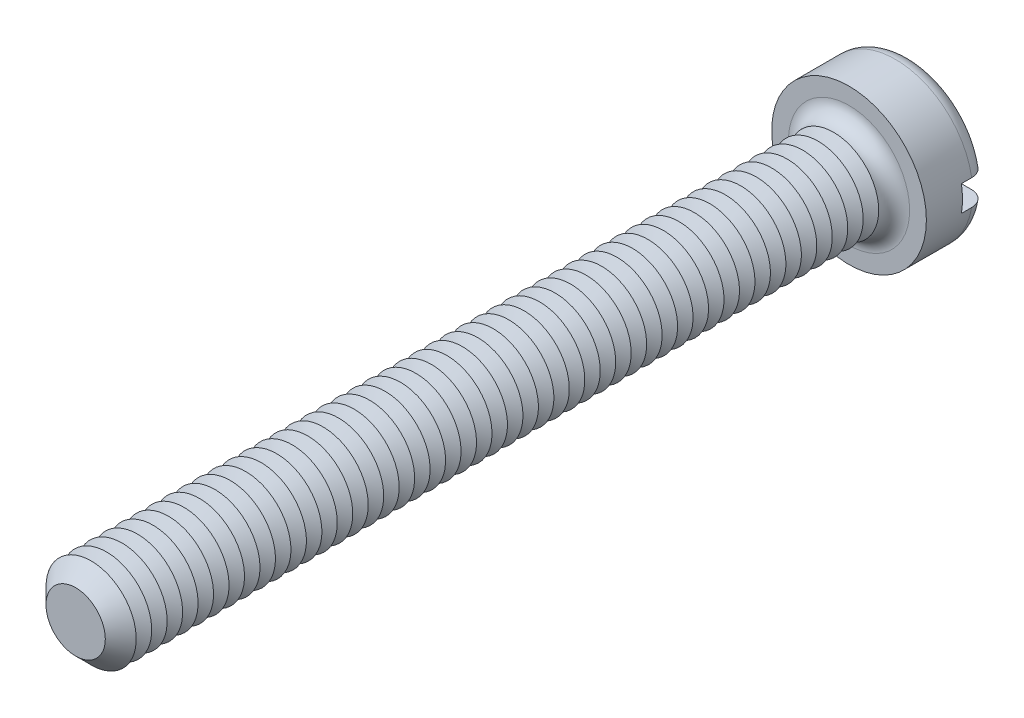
ISO-10303-21;
HEADER;
FILE_DESCRIPTION(('STEP AP214'),'2;1');
FILE_NAME('part.step','',(''),(''),'','','');
FILE_SCHEMA(('AUTOMOTIVE_DESIGN { 1 0 10303 214 1 1 1 1 }'));
ENDSEC;
DATA;
#1=APPLICATION_CONTEXT('core data for automotive mechanical design processes');
#2=APPLICATION_PROTOCOL_DEFINITION('international standard','automotive_design',2000,#1);
#3=PRODUCT_CONTEXT('',#1,'mechanical');
#4=PRODUCT('Part','Part','',(#3));
#5=PRODUCT_RELATED_PRODUCT_CATEGORY('part','',(#4));
#6=PRODUCT_DEFINITION_FORMATION('','',#4);
#7=PRODUCT_DEFINITION_CONTEXT('part definition',#1,'design');
#8=PRODUCT_DEFINITION('design','',#6,#7);
#9=PRODUCT_DEFINITION_SHAPE('','',#8);
#10=(LENGTH_UNIT() NAMED_UNIT(*) SI_UNIT(.MILLI.,.METRE.));
#11=(NAMED_UNIT(*) PLANE_ANGLE_UNIT() SI_UNIT($,.RADIAN.));
#12=(NAMED_UNIT(*) SI_UNIT($,.STERADIAN.) SOLID_ANGLE_UNIT());
#13=UNCERTAINTY_MEASURE_WITH_UNIT(LENGTH_MEASURE(1.E-05),#10,'distance_accuracy_value','');
#14=(GEOMETRIC_REPRESENTATION_CONTEXT(3) GLOBAL_UNCERTAINTY_ASSIGNED_CONTEXT((#13)) GLOBAL_UNIT_ASSIGNED_CONTEXT((#10,
#11,#12)) REPRESENTATION_CONTEXT('',''));
#15=CARTESIAN_POINT('',(0.,0.,0.));
#16=DIRECTION('',(0.,0.,1.));
#17=DIRECTION('',(1.,0.,0.));
#18=AXIS2_PLACEMENT_3D('',#15,#16,#17);
#19=CARTESIAN_POINT('',(0.,0.,-2.4));
#20=DIRECTION('',(0.,0.,1.));
#21=DIRECTION('',(1.,0.,0.));
#22=AXIS2_PLACEMENT_3D('',#19,#20,#21);
#23=PLANE('',#22);
#24=CARTESIAN_POINT('',(0.,0.,-2.4));
#25=DIRECTION('',(0.,0.,1.));
#26=DIRECTION('',(1.,0.,0.));
#27=AXIS2_PLACEMENT_3D('',#24,#25,#26);
#28=CIRCLE('',#27,2.4);
#29=CARTESIAN_POINT('',(-2.3473389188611,0.5,-2.4));
#30=VERTEX_POINT('',#29);
#31=CARTESIAN_POINT('',(2.3473389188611,0.5,-2.4));
#32=VERTEX_POINT('',#31);
#33=EDGE_CURVE('E116',#30,#32,#28,.F.);
#34=ORIENTED_EDGE('',*,*,#33,.T.);
#35=DIRECTION('',(1.,0.,0.));
#36=VECTOR('',#35,1.);
#37=CARTESIAN_POINT('',(-3.,0.5,-2.4));
#38=LINE('',#37,#36);
#39=EDGE_CURVE('E111',#30,#32,#38,.T.);
#40=ORIENTED_EDGE('',*,*,#39,.F.);
#41=EDGE_LOOP('',(#34,#40));
#42=FACE_BOUND('',#41,.T.);
#43=ADVANCED_FACE('F39',(#42),#23,.F.);
#44=CARTESIAN_POINT('',(0.,0.,-1.8));
#45=DIRECTION('',(0.,0.,1.));
#46=DIRECTION('',(1.,0.,0.));
#47=AXIS2_PLACEMENT_3D('',#44,#45,#46);
#48=TOROIDAL_SURFACE('',#47,2.4,0.6);
#49=CARTESIAN_POINT('',(-2.85761641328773,0.5,-2.13010535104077));
#50=CARTESIAN_POINT('',(-2.83871556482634,0.5,-2.1583605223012));
#51=CARTESIAN_POINT('',(-2.81738546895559,0.5,-2.18502342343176));
#52=CARTESIAN_POINT('',(-2.7705148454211,0.5,-2.23439244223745));
#53=CARTESIAN_POINT('',(-2.74496859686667,0.5,-2.25709309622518));
#54=CARTESIAN_POINT('',(-2.6904684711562,0.5,-2.29787524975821));
#55=CARTESIAN_POINT('',(-2.66151863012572,0.5,-2.3159621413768));
#56=CARTESIAN_POINT('',(-2.60103287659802,0.5,-2.34708203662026));
#57=CARTESIAN_POINT('',(-2.56949759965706,0.5,-2.36011627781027));
#58=CARTESIAN_POINT('',(-2.50430694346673,0.5,-2.38095952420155));
#59=CARTESIAN_POINT('',(-2.47062984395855,0.5,-2.38870056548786));
#60=CARTESIAN_POINT('',(-2.40245905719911,0.5,-2.39852415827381));
#61=CARTESIAN_POINT('',(-2.36796525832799,0.5,-2.40060593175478));
#62=CARTESIAN_POINT('',(-2.29850850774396,0.5,-2.39907718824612));
#63=CARTESIAN_POINT('',(-2.2635477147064,0.5,-2.3953679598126));
#64=CARTESIAN_POINT('',(-2.19472542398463,0.5,-2.38219781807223));
#65=CARTESIAN_POINT('',(-2.16086402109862,0.5,-2.37273641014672));
#66=CARTESIAN_POINT('',(-2.09483473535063,0.5,-2.3481926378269));
#67=CARTESIAN_POINT('',(-2.06268841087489,0.5,-2.3330521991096));
#68=CARTESIAN_POINT('',(-2.00140871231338,0.5,-2.29756210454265));
#69=CARTESIAN_POINT('',(-1.97227539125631,0.5,-2.27721235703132));
#70=CARTESIAN_POINT('',(-1.91805676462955,0.5,-2.23196210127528));
#71=CARTESIAN_POINT('',(-1.89294995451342,0.5,-2.20708739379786));
#72=CARTESIAN_POINT('',(-1.84740424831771,0.5,-2.1533758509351));
#73=CARTESIAN_POINT('',(-1.82696468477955,0.5,-2.12453958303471));
#74=CARTESIAN_POINT('',(-1.7919439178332,0.5,-2.06452274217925));
#75=CARTESIAN_POINT('',(-1.7772221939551,0.5,-2.03342424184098));
#76=CARTESIAN_POINT('',(-1.75343025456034,0.5,-1.96913621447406));
#77=CARTESIAN_POINT('',(-1.74435859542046,0.5,-1.93594722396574));
#78=CARTESIAN_POINT('',(-1.73243855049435,0.5,-1.86969199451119));
#79=CARTESIAN_POINT('',(-1.72938008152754,0.5,-1.83666346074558));
#80=CARTESIAN_POINT('',(-1.72896592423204,0.5,-1.77057287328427));
#81=CARTESIAN_POINT('',(-1.73160950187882,0.5,-1.73751082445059));
#82=CARTESIAN_POINT('',(-1.7423966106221,0.5,-1.67291835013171));
#83=CARTESIAN_POINT('',(-1.75043952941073,0.5,-1.64137102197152));
#84=CARTESIAN_POINT('',(-1.77163396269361,0.5,-1.58004446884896));
#85=CARTESIAN_POINT('',(-1.78478577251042,0.5,-1.55026534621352));
#86=CARTESIAN_POINT('',(-1.81598186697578,0.5,-1.49283859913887));
#87=CARTESIAN_POINT('',(-1.83409369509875,0.5,-1.46522772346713));
#88=CARTESIAN_POINT('',(-1.87455179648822,0.5,-1.41330756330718));
#89=CARTESIAN_POINT('',(-1.89689874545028,0.5,-1.38899880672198));
#90=CARTESIAN_POINT('',(-1.94600584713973,0.5,-1.34349499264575));
#91=CARTESIAN_POINT('',(-1.97289034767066,0.5,-1.32243411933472));
#92=CARTESIAN_POINT('',(-2.02972905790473,0.5,-1.28496935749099));
#93=CARTESIAN_POINT('',(-2.05968375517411,0.5,-1.26856621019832));
#94=CARTESIAN_POINT('',(-2.12276894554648,0.5,-1.24040709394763));
#95=CARTESIAN_POINT('',(-2.15596700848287,0.5,-1.22880230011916));
#96=CARTESIAN_POINT('',(-2.22383000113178,0.5,-1.21126311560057));
#97=CARTESIAN_POINT('',(-2.25849504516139,0.5,-1.20532916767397));
#98=CARTESIAN_POINT('',(-2.32870403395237,0.5,-1.1992792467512));
#99=CARTESIAN_POINT('',(-2.36425340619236,0.5,-1.19922586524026));
#100=CARTESIAN_POINT('',(-2.4348506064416,0.5,-1.2051326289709));
#101=CARTESIAN_POINT('',(-2.4698984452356,0.5,-1.21109264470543));
#102=CARTESIAN_POINT('',(-2.53821803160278,0.5,-1.22883658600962));
#103=CARTESIAN_POINT('',(-2.57150081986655,0.5,-1.24057794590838));
#104=CARTESIAN_POINT('',(-2.63557260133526,0.5,-1.2695744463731));
#105=CARTESIAN_POINT('',(-2.66636179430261,0.5,-1.28682914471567));
#106=CARTESIAN_POINT('',(-2.72402406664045,0.5,-1.32606063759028));
#107=CARTESIAN_POINT('',(-2.75095352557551,0.5,-1.34795455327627));
#108=CARTESIAN_POINT('',(-2.80067182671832,0.5,-1.39602603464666));
#109=CARTESIAN_POINT('',(-2.82346106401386,0.5,-1.42220319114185));
#110=CARTESIAN_POINT('',(-2.86383281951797,0.5,-1.47760238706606));
#111=CARTESIAN_POINT('',(-2.88149947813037,0.5,-1.50676312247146));
#112=CARTESIAN_POINT('',(-2.91160874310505,0.5,-1.56766595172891));
#113=CARTESIAN_POINT('',(-2.92405198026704,0.5,-1.59940773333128));
#114=CARTESIAN_POINT('',(-2.94319943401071,0.5,-1.66411282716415));
#115=CARTESIAN_POINT('',(-2.94997843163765,0.5,-1.69705402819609));
#116=CARTESIAN_POINT('',(-2.95787009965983,0.5,-1.7636173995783));
#117=CARTESIAN_POINT('',(-2.95898157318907,0.5,-1.79723971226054));
#118=CARTESIAN_POINT('',(-2.95551354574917,0.5,-1.86397776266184));
#119=CARTESIAN_POINT('',(-2.95096897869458,0.5,-1.89709534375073));
#120=CARTESIAN_POINT('',(-2.93638731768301,0.5,-1.96206785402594));
#121=CARTESIAN_POINT('',(-2.92635713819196,0.5,-1.99392431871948));
#122=CARTESIAN_POINT('',(-2.90618743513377,0.5,-2.04315073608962));
#123=CARTESIAN_POINT('',(-2.89769874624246,0.5,-2.06121519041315));
#124=CARTESIAN_POINT('',(-2.87895753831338,0.5,-2.096404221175));
#125=CARTESIAN_POINT('',(-2.86870503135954,0.5,-2.11352880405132));
#126=CARTESIAN_POINT('',(-2.85761641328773,0.5,-2.13010535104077));
#127=B_SPLINE_CURVE_WITH_KNOTS('',3,(#49,#50,#51,#52,#53,#54,#55,#56,#57,#58,#59,#60,#61,#62,
#63,#64,#65,#66,#67,#68,#69,#70,#71,#72,#73,#74,#75,#76,#77,#78,#79,#80,#81,#82,#83,#84,#85,#86,
#87,#88,#89,#90,#91,#92,#93,#94,#95,#96,#97,#98,#99,#100,#101,#102,#103,#104,#105,#106,#107,
#108,#109,#110,#111,#112,#113,#114,#115,#116,#117,#118,#119,#120,#121,#122,#123,#124,#125,#126),
.UNSPECIFIED.,.T.,.F.,(4,2,2,2,2,2,2,2,2,2,2,2,2,2,2,2,2,2,2,2,2,2,2,2,2,2,2,2,2,2,2,2,2,2,2,2,
2,2,4),(0.,0.101907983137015,0.203955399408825,0.305883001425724,0.407785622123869,
0.510973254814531,0.614175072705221,0.719155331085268,0.824144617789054,0.930238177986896,
1.03633360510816,1.14184204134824,1.24733537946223,1.35004136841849,1.45272110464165,
1.5517448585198,1.65075586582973,1.74797128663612,1.84519232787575,1.9438094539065,
2.0424423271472,2.14443321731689,2.24644032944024,2.35145317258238,2.45647421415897,
2.56261297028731,2.66874944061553,2.77411589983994,2.87947390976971,2.98308820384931,
3.08669260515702,3.18848388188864,3.29026286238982,3.39067588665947,3.49111011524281,
3.59092708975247,3.69061853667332,3.75040561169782,3.81019227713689),.UNSPECIFIED.);
#128=CARTESIAN_POINT('',(-2.95803989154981,0.5,-1.8));
#129=VERTEX_POINT('',#128);
#130=EDGE_CURVE('E562',#129,#30,#127,.T.);
#131=ORIENTED_EDGE('',*,*,#130,.F.);
#132=CARTESIAN_POINT('',(0.,0.,-1.8));
#133=DIRECTION('',(0.,0.,1.));
#134=DIRECTION('',(1.,0.,0.));
#135=AXIS2_PLACEMENT_3D('',#132,#133,#134);
#136=CIRCLE('',#135,3.);
#137=CARTESIAN_POINT('',(2.95803989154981,0.5,-1.8));
#138=VERTEX_POINT('',#137);
#139=EDGE_CURVE('E124',#138,#129,#136,.T.);
#140=ORIENTED_EDGE('',*,*,#139,.F.);
#141=CARTESIAN_POINT('',(1.78664846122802,0.5,-2.05158390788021));
#142=CARTESIAN_POINT('',(1.80142751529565,0.5,-2.08239430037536));
#143=CARTESIAN_POINT('',(1.81889355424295,0.5,-2.111949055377));
#144=CARTESIAN_POINT('',(1.8585933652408,0.5,-2.16770384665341));
#145=CARTESIAN_POINT('',(1.88083491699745,0.5,-2.19389829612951));
#146=CARTESIAN_POINT('',(1.92931942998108,0.5,-2.24217519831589));
#147=CARTESIAN_POINT('',(1.95555471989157,0.5,-2.26426535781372));
#148=CARTESIAN_POINT('',(2.01127789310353,0.5,-2.30384045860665));
#149=CARTESIAN_POINT('',(2.04076488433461,0.5,-2.32132665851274));
#150=CARTESIAN_POINT('',(2.10290022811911,0.5,-2.3516259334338));
#151=CARTESIAN_POINT('',(2.13560600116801,0.5,-2.3643213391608));
#152=CARTESIAN_POINT('',(2.20267136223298,0.5,-2.38412242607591));
#153=CARTESIAN_POINT('',(2.23703118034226,0.5,-2.3912273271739));
#154=CARTESIAN_POINT('',(2.30690186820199,0.5,-2.39969404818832));
#155=CARTESIAN_POINT('',(2.34242185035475,0.5,-2.40098100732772));
#156=CARTESIAN_POINT('',(2.41317063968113,0.5,-2.39753827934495));
#157=CARTESIAN_POINT('',(2.44839945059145,0.5,-2.39280866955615));
#158=CARTESIAN_POINT('',(2.51734146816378,0.5,-2.37746773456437));
#159=CARTESIAN_POINT('',(2.55106223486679,0.5,-2.3668904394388));
#160=CARTESIAN_POINT('',(2.61620389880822,0.5,-2.34013333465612));
#161=CARTESIAN_POINT('',(2.64762498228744,0.5,-2.32395397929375));
#162=CARTESIAN_POINT('',(2.70673284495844,0.5,-2.28672393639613));
#163=CARTESIAN_POINT('',(2.73447138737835,0.5,-2.26575544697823));
#164=CARTESIAN_POINT('',(2.78595339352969,0.5,-2.21938197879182));
#165=CARTESIAN_POINT('',(2.80969724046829,0.5,-2.19397742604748));
#166=CARTESIAN_POINT('',(2.85207235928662,0.5,-2.13993965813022));
#167=CARTESIAN_POINT('',(2.87078674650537,0.5,-2.11137160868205));
#168=CARTESIAN_POINT('',(2.90307455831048,0.5,-2.05146448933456));
#169=CARTESIAN_POINT('',(2.91664841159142,0.5,-2.02012565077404));
#170=CARTESIAN_POINT('',(2.93808283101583,0.5,-1.95603682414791));
#171=CARTESIAN_POINT('',(2.94602016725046,0.5,-1.92331249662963));
#172=CARTESIAN_POINT('',(2.95624273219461,0.5,-1.85699296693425));
#173=CARTESIAN_POINT('',(2.95852824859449,0.5,-1.82339780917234));
#174=CARTESIAN_POINT('',(2.95738171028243,0.5,-1.75655451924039));
#175=CARTESIAN_POINT('',(2.95399174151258,0.5,-1.72330565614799));
#176=CARTESIAN_POINT('',(2.94167749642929,0.5,-1.65784996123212));
#177=CARTESIAN_POINT('',(2.93275329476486,0.5,-1.62564311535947));
#178=CARTESIAN_POINT('',(2.90963870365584,0.5,-1.56317641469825));
#179=CARTESIAN_POINT('',(2.89544787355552,0.5,-1.53291672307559));
#180=CARTESIAN_POINT('',(2.86222325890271,0.5,-1.47518589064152));
#181=CARTESIAN_POINT('',(2.84318935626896,0.5,-1.44771481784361));
#182=CARTESIAN_POINT('',(2.80067851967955,0.5,-1.39611362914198));
#183=CARTESIAN_POINT('',(2.77716960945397,0.5,-1.37200986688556));
#184=CARTESIAN_POINT('',(2.72648704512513,0.5,-1.3280274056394));
#185=CARTESIAN_POINT('',(2.69931317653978,0.5,-1.3081489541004));
#186=CARTESIAN_POINT('',(2.64167967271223,0.5,-1.27288334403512));
#187=CARTESIAN_POINT('',(2.61118015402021,0.5,-1.25756138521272));
#188=CARTESIAN_POINT('',(2.54807315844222,0.5,-1.2321564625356));
#189=CARTESIAN_POINT('',(2.51546550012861,0.5,-1.22207395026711));
#190=CARTESIAN_POINT('',(2.44846246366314,0.5,-1.20724783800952));
#191=CARTESIAN_POINT('',(2.41404584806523,0.5,-1.2026002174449));
#192=CARTESIAN_POINT('',(2.34491756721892,0.5,-1.19904907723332));
#193=CARTESIAN_POINT('',(2.3102058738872,0.5,-1.20014611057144));
#194=CARTESIAN_POINT('',(2.24087507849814,0.5,-1.20808958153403));
#195=CARTESIAN_POINT('',(2.20626660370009,0.5,-1.21502895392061));
#196=CARTESIAN_POINT('',(2.13868705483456,0.5,-1.23457616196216));
#197=CARTESIAN_POINT('',(2.10571611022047,0.5,-1.24718444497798));
#198=CARTESIAN_POINT('',(2.04212010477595,0.5,-1.2778419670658));
#199=CARTESIAN_POINT('',(2.0115131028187,0.5,-1.29592871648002));
#200=CARTESIAN_POINT('',(1.95381117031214,0.5,-1.33703838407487));
#201=CARTESIAN_POINT('',(1.92671618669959,0.5,-1.36006122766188));
#202=CARTESIAN_POINT('',(1.8771749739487,0.5,-1.41014760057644));
#203=CARTESIAN_POINT('',(1.85467966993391,0.5,-1.43716252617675));
#204=CARTESIAN_POINT('',(1.8147167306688,0.5,-1.49468601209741));
#205=CARTESIAN_POINT('',(1.79724791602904,0.5,-1.52519375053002));
#206=CARTESIAN_POINT('',(1.76843420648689,0.5,-1.58782676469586));
#207=CARTESIAN_POINT('',(1.75691546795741,0.5,-1.61987202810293));
#208=CARTESIAN_POINT('',(1.73963101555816,0.5,-1.68548715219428));
#209=CARTESIAN_POINT('',(1.73386545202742,0.5,-1.71905705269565));
#210=CARTESIAN_POINT('',(1.72840927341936,0.5,-1.78556262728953));
#211=CARTESIAN_POINT('',(1.72852416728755,0.5,-1.8184825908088));
#212=CARTESIAN_POINT('',(1.73434422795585,0.5,-1.88379362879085));
#213=CARTESIAN_POINT('',(1.74004181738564,0.5,-1.91618535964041));
#214=CARTESIAN_POINT('',(1.75312909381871,0.5,-1.96568884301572));
#215=CARTESIAN_POINT('',(1.75869685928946,0.5,-1.98330302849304));
#216=CARTESIAN_POINT('',(1.77146455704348,0.5,-2.01792824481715));
#217=CARTESIAN_POINT('',(1.7786644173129,0.5,-2.03493930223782));
#218=CARTESIAN_POINT('',(1.78664846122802,0.5,-2.05158390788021));
#219=B_SPLINE_CURVE_WITH_KNOTS('',3,(#141,#142,#143,#144,#145,#146,#147,#148,#149,#150,#151,
#152,#153,#154,#155,#156,#157,#158,#159,#160,#161,#162,#163,#164,#165,#166,#167,#168,#169,#170,
#171,#172,#173,#174,#175,#176,#177,#178,#179,#180,#181,#182,#183,#184,#185,#186,#187,#188,#189,
#190,#191,#192,#193,#194,#195,#196,#197,#198,#199,#200,#201,#202,#203,#204,#205,#206,#207,#208,
#209,#210,#211,#212,#213,#214,#215,#216,#217,#218),.UNSPECIFIED.,.T.,.F.,(4,2,2,2,2,2,2,2,2,2,2,
2,2,2,2,2,2,2,2,2,2,2,2,2,2,2,2,2,2,2,2,2,2,2,2,2,2,2,4),(0.,0.10244464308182,0.205057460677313,
0.307475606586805,0.409865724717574,0.514628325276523,0.619405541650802,0.72552718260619,
0.831647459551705,0.937156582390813,1.04265715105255,1.1464674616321,1.25026780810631,
1.3522293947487,1.45418247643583,1.55471883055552,1.6552500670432,1.75503912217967,
1.8548268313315,1.95462289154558,2.05442138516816,2.15496174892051,2.25550799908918,
2.35743049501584,2.45936177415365,2.56306719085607,2.66678259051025,2.77217967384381,
2.87758507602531,2.98372914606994,3.08987161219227,3.19481457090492,3.29973288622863,
3.40138228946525,3.50303434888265,3.60132659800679,3.69948562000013,3.75483142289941,
3.8101747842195),.UNSPECIFIED.);
#220=EDGE_CURVE('E564',#32,#138,#219,.T.);
#221=ORIENTED_EDGE('',*,*,#220,.F.);
#222=ORIENTED_EDGE('',*,*,#33,.F.);
#223=EDGE_LOOP('',(#131,#140,#221,#222));
#224=FACE_BOUND('',#223,.T.);
#225=ADVANCED_FACE('F546',(#224),#48,.T.);
#226=CARTESIAN_POINT('',(0.,0.,-2.4));
#227=DIRECTION('',(0.,0.,1.));
#228=DIRECTION('',(1.,0.,0.));
#229=AXIS2_PLACEMENT_3D('',#226,#227,#228);
#230=CYLINDRICAL_SURFACE('',#229,3.);
#231=DIRECTION('',(0.,0.,1.));
#232=VECTOR('',#231,1.);
#233=CARTESIAN_POINT('',(2.95803989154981,0.5,-2.4));
#234=LINE('',#233,#232);
#235=CARTESIAN_POINT('',(2.95803989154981,0.5,-1.4));
#236=VERTEX_POINT('',#235);
#237=EDGE_CURVE('E577',#138,#236,#234,.T.);
#238=ORIENTED_EDGE('',*,*,#237,.F.);
#239=ORIENTED_EDGE('',*,*,#139,.T.);
#240=DIRECTION('',(0.,0.,1.));
#241=VECTOR('',#240,1.);
#242=CARTESIAN_POINT('',(-2.95803989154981,0.5,-2.4));
#243=LINE('',#242,#241);
#244=CARTESIAN_POINT('',(-2.95803989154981,0.5,-1.4));
#245=VERTEX_POINT('',#244);
#246=EDGE_CURVE('E63',#245,#129,#243,.F.);
#247=ORIENTED_EDGE('',*,*,#246,.F.);
#248=CARTESIAN_POINT('',(0.,0.,-1.4));
#249=DIRECTION('',(0.,0.,-1.));
#250=DIRECTION('',(-1.,0.,0.));
#251=AXIS2_PLACEMENT_3D('',#248,#249,#250);
#252=CIRCLE('',#251,3.);
#253=CARTESIAN_POINT('',(-2.95803989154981,-0.5,-1.4));
#254=VERTEX_POINT('',#253);
#255=EDGE_CURVE('E43',#245,#254,#252,.F.);
#256=ORIENTED_EDGE('',*,*,#255,.T.);
#257=DIRECTION('',(0.,0.,1.));
#258=VECTOR('',#257,1.);
#259=CARTESIAN_POINT('',(-2.95803989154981,-0.5,-2.4));
#260=LINE('',#259,#258);
#261=CARTESIAN_POINT('',(-2.9580398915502,-0.5,-1.79999999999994));
#262=VERTEX_POINT('',#261);
#263=EDGE_CURVE('E574',#262,#254,#260,.T.);
#264=ORIENTED_EDGE('',*,*,#263,.F.);
#265=CARTESIAN_POINT('',(2.95803989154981,-0.5,-1.8));
#266=VERTEX_POINT('',#265);
#267=EDGE_CURVE('E126',#262,#266,#136,.T.);
#268=ORIENTED_EDGE('',*,*,#267,.T.);
#269=DIRECTION('',(0.,0.,1.));
#270=VECTOR('',#269,1.);
#271=CARTESIAN_POINT('',(2.95803989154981,-0.5,-2.4));
#272=LINE('',#271,#270);
#273=CARTESIAN_POINT('',(2.95803989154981,-0.5,-1.4));
#274=VERTEX_POINT('',#273);
#275=EDGE_CURVE('E55',#274,#266,#272,.F.);
#276=ORIENTED_EDGE('',*,*,#275,.F.);
#277=EDGE_CURVE('E11',#274,#236,#252,.F.);
#278=ORIENTED_EDGE('',*,*,#277,.T.);
#279=EDGE_LOOP('',(#238,#239,#247,#256,#264,#268,#276,#278));
#280=FACE_BOUND('',#279,.T.);
#281=CARTESIAN_POINT('',(0.,0.,0.));
#282=DIRECTION('',(0.,0.,1.));
#283=DIRECTION('',(1.,0.,0.));
#284=AXIS2_PLACEMENT_3D('',#281,#282,#283);
#285=CIRCLE('',#284,3.);
#286=CARTESIAN_POINT('',(3.,0.,0.));
#287=VERTEX_POINT('',#286);
#288=EDGE_CURVE('E580',#287,#287,#285,.T.);
#289=ORIENTED_EDGE('',*,*,#288,.F.);
#290=EDGE_LOOP('',(#289));
#291=FACE_BOUND('',#290,.T.);
#292=ADVANCED_FACE('F542',(#280,#291),#230,.T.);
#293=CARTESIAN_POINT('',(2.3473389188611,-0.5,-2.4));
#294=VERTEX_POINT('',#293);
#295=CARTESIAN_POINT('',(-2.3473389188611,-0.5,-2.4));
#296=VERTEX_POINT('',#295);
#297=EDGE_CURVE('E109',#294,#296,#28,.F.);
#298=ORIENTED_EDGE('',*,*,#297,.T.);
#299=DIRECTION('',(-1.,0.,0.));
#300=VECTOR('',#299,1.);
#301=CARTESIAN_POINT('',(-3.,-0.5,-2.4));
#302=LINE('',#301,#300);
#303=EDGE_CURVE('E96',#294,#296,#302,.T.);
#304=ORIENTED_EDGE('',*,*,#303,.F.);
#305=EDGE_LOOP('',(#298,#304));
#306=FACE_BOUND('',#305,.T.);
#307=ADVANCED_FACE('F108',(#306),#23,.F.);
#308=CARTESIAN_POINT('',(0.,0.,0.));
#309=DIRECTION('',(0.,0.,1.));
#310=DIRECTION('',(1.,0.,0.));
#311=AXIS2_PLACEMENT_3D('',#308,#309,#310);
#312=PLANE('',#311);
#313=CARTESIAN_POINT('',(0.,0.,0.));
#314=DIRECTION('',(0.,0.,1.));
#315=DIRECTION('',(1.,0.,0.));
#316=AXIS2_PLACEMENT_3D('',#313,#314,#315);
#317=CIRCLE('',#316,2.35);
#318=CARTESIAN_POINT('',(2.35,0.,0.));
#319=VERTEX_POINT('',#318);
#320=EDGE_CURVE('E115',#319,#319,#317,.F.);
#321=ORIENTED_EDGE('',*,*,#320,.T.);
#322=EDGE_LOOP('',(#321));
#323=FACE_BOUND('',#322,.T.);
#324=ORIENTED_EDGE('',*,*,#288,.T.);
#325=EDGE_LOOP('',(#324));
#326=FACE_BOUND('',#325,.T.);
#327=ADVANCED_FACE('F541',(#323,#326),#312,.T.);
#328=CARTESIAN_POINT('',(-2.85761641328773,-0.5,-2.13010535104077));
#329=CARTESIAN_POINT('',(-2.87617085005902,-0.5,-2.10236255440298));
#330=CARTESIAN_POINT('',(-2.89241094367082,-0.5,-2.07304478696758));
#331=CARTESIAN_POINT('',(-2.91975805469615,-0.5,-2.01207835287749));
#332=CARTESIAN_POINT('',(-2.93085958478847,-0.5,-1.98042723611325));
#333=CARTESIAN_POINT('',(-2.94757590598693,-0.5,-1.91570997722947));
#334=CARTESIAN_POINT('',(-2.95319165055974,-0.5,-1.88264408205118));
#335=CARTESIAN_POINT('',(-2.95876526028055,-0.5,-1.81604673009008));
#336=CARTESIAN_POINT('',(-2.95872441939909,-0.5,-1.78251538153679));
#337=CARTESIAN_POINT('',(-2.95300126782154,-0.5,-1.71606888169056));
#338=CARTESIAN_POINT('',(-2.94734076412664,-0.5,-1.68315184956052));
#339=CARTESIAN_POINT('',(-2.93058183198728,-0.5,-1.61873244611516));
#340=CARTESIAN_POINT('',(-2.91948325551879,-0.5,-1.58723011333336));
#341=CARTESIAN_POINT('',(-2.89215903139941,-0.5,-1.52647404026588));
#342=CARTESIAN_POINT('',(-2.87592518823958,-0.5,-1.49722398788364));
#343=CARTESIAN_POINT('',(-2.83881787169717,-0.5,-1.44183365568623));
#344=CARTESIAN_POINT('',(-2.81794425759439,-0.5,-1.41569347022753));
#345=CARTESIAN_POINT('',(-2.77196258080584,-0.5,-1.36700890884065));
#346=CARTESIAN_POINT('',(-2.74681874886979,-0.5,-1.34449832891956));
#347=CARTESIAN_POINT('',(-2.69315595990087,-0.5,-1.30394571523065));
#348=CARTESIAN_POINT('',(-2.66463678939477,-0.5,-1.28590396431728));
#349=CARTESIAN_POINT('',(-2.6045885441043,-0.5,-1.25451133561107));
#350=CARTESIAN_POINT('',(-2.573021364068,-0.5,-1.24123336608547));
#351=CARTESIAN_POINT('',(-2.50813094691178,-0.5,-1.22006271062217));
#352=CARTESIAN_POINT('',(-2.47480755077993,-0.5,-1.21217051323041));
#353=CARTESIAN_POINT('',(-2.40672281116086,-0.5,-1.20185046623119));
#354=CARTESIAN_POINT('',(-2.37194646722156,-0.5,-1.19952155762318));
#355=CARTESIAN_POINT('',(-2.30248663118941,-0.5,-1.20064178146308));
#356=CARTESIAN_POINT('',(-2.26780314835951,-0.5,-1.20409147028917));
#357=CARTESIAN_POINT('',(-2.19896003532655,-0.5,-1.21674803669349));
#358=CARTESIAN_POINT('',(-2.16481620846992,-0.5,-1.22604100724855));
#359=CARTESIAN_POINT('',(-2.09855902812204,-0.5,-1.25020237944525));
#360=CARTESIAN_POINT('',(-2.0664458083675,-0.5,-1.2650711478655));
#361=CARTESIAN_POINT('',(-2.00504979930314,-0.5,-1.3000633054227));
#362=CARTESIAN_POINT('',(-1.97577870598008,-0.5,-1.32020724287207));
#363=CARTESIAN_POINT('',(-1.92109882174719,-0.5,-1.36519538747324));
#364=CARTESIAN_POINT('',(-1.89568984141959,-0.5,-1.39003936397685));
#365=CARTESIAN_POINT('',(-1.84992350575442,-0.5,-1.44333696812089));
#366=CARTESIAN_POINT('',(-1.82949305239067,-0.5,-1.47172774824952));
#367=CARTESIAN_POINT('',(-1.79388305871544,-0.5,-1.53163225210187));
#368=CARTESIAN_POINT('',(-1.77870235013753,-0.5,-1.56314527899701));
#369=CARTESIAN_POINT('',(-1.7545759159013,-0.5,-1.62726698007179));
#370=CARTESIAN_POINT('',(-1.74543784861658,-0.5,-1.65980327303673));
#371=CARTESIAN_POINT('',(-1.73294830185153,-0.5,-1.72596654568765));
#372=CARTESIAN_POINT('',(-1.72959555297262,-0.5,-1.7595932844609));
#373=CARTESIAN_POINT('',(-1.72881879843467,-0.5,-1.82588200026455));
#374=CARTESIAN_POINT('',(-1.73121660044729,-0.5,-1.85854202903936));
#375=CARTESIAN_POINT('',(-1.74148022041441,-0.5,-1.9229888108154));
#376=CARTESIAN_POINT('',(-1.74934586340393,-0.5,-1.95477559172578));
#377=CARTESIAN_POINT('',(-1.77023164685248,-0.5,-2.01650910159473));
#378=CARTESIAN_POINT('',(-1.78323812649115,-0.5,-2.04646046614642));
#379=CARTESIAN_POINT('',(-1.81396733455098,-0.5,-2.10383471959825));
#380=CARTESIAN_POINT('',(-1.83169061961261,-0.5,-2.13125730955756));
#381=CARTESIAN_POINT('',(-1.87183626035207,-0.5,-2.18359240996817));
#382=CARTESIAN_POINT('',(-1.89437158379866,-0.5,-2.20841820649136));
#383=CARTESIAN_POINT('',(-1.9431646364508,-0.5,-2.25409214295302));
#384=CARTESIAN_POINT('',(-1.96942301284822,-0.5,-2.27493958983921));
#385=CARTESIAN_POINT('',(-2.025898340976,-0.5,-2.31281042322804));
#386=CARTESIAN_POINT('',(-2.05622082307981,-0.5,-2.32967654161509));
#387=CARTESIAN_POINT('',(-2.11922391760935,-0.5,-2.35820255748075));
#388=CARTESIAN_POINT('',(-2.15190483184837,-0.5,-2.3698617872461));
#389=CARTESIAN_POINT('',(-2.21944675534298,-0.5,-2.38785911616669));
#390=CARTESIAN_POINT('',(-2.25433929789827,-0.5,-2.39407914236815));
#391=CARTESIAN_POINT('',(-2.32467357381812,-0.5,-2.40058243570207));
#392=CARTESIAN_POINT('',(-2.36011530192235,-0.5,-2.40086575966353));
#393=CARTESIAN_POINT('',(-2.43058129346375,-0.5,-2.39545061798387));
#394=CARTESIAN_POINT('',(-2.46560504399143,-0.5,-2.38974544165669));
#395=CARTESIAN_POINT('',(-2.53418188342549,-0.5,-2.37245602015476));
#396=CARTESIAN_POINT('',(-2.56773468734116,-0.5,-2.36087064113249));
#397=CARTESIAN_POINT('',(-2.63195003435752,-0.5,-2.33229154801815));
#398=CARTESIAN_POINT('',(-2.66264330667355,-0.5,-2.31536681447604));
#399=CARTESIAN_POINT('',(-2.72065333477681,-0.5,-2.2765252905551));
#400=CARTESIAN_POINT('',(-2.7479744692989,-0.5,-2.25461508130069));
#401=CARTESIAN_POINT('',(-2.78903570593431,-0.5,-2.21539504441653));
#402=CARTESIAN_POINT('',(-2.80405150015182,-0.5,-2.19939833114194));
#403=CARTESIAN_POINT('',(-2.83224965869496,-0.5,-2.16586257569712));
#404=CARTESIAN_POINT('',(-2.84543204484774,-0.5,-2.14832355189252));
#405=CARTESIAN_POINT('',(-2.85761641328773,-0.5,-2.13010535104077));
#406=B_SPLINE_CURVE_WITH_KNOTS('',3,(#328,#329,#330,#331,#332,#333,#334,#335,#336,#337,#338,
#339,#340,#341,#342,#343,#344,#345,#346,#347,#348,#349,#350,#351,#352,#353,#354,#355,#356,#357,
#358,#359,#360,#361,#362,#363,#364,#365,#366,#367,#368,#369,#370,#371,#372,#373,#374,#375,#376,
#377,#378,#379,#380,#381,#382,#383,#384,#385,#386,#387,#388,#389,#390,#391,#392,#393,#394,#395,
#396,#397,#398,#399,#400,#401,#402,#403,#404,#405),.UNSPECIFIED.,.T.,.F.,(4,2,2,2,2,2,2,2,2,2,2,
2,2,2,2,2,2,2,2,2,2,2,2,2,2,2,2,2,2,2,2,2,2,2,2,2,2,2,4),(0.,0.100047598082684,
0.200201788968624,0.300338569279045,0.400452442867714,0.500179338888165,0.599908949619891,
0.699798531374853,0.799691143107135,0.900465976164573,1.00124718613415,1.10351091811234,
1.20578392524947,1.30986270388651,1.41395150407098,1.51961105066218,1.62527754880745,
1.73136193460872,1.83744111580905,1.94185359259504,2.04624281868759,2.1471248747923,
2.24798479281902,2.34575994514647,2.44353196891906,2.541045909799,2.63857136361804,
2.73870431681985,2.83885469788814,2.94247024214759,3.0460990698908,3.15192527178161,
3.25775046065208,3.36369436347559,3.46965870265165,3.57430655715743,3.67881706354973,
3.74451732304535,3.81021680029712),.UNSPECIFIED.);
#407=EDGE_CURVE('E103',#296,#262,#406,.T.);
#408=ORIENTED_EDGE('',*,*,#407,.F.);
#409=ORIENTED_EDGE('',*,*,#297,.F.);
#410=CARTESIAN_POINT('',(1.78664846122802,-0.5,-2.05158390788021));
#411=CARTESIAN_POINT('',(1.77253256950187,-0.5,-2.02214917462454));
#412=CARTESIAN_POINT('',(1.76084795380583,-0.5,-1.99152692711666));
#413=CARTESIAN_POINT('',(1.74276267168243,-0.5,-1.92873811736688));
#414=CARTESIAN_POINT('',(1.73636622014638,-0.5,-1.89657034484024));
#415=CARTESIAN_POINT('',(1.72910271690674,-0.5,-1.83160458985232));
#416=CARTESIAN_POINT('',(1.72823699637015,-0.5,-1.79880645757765));
#417=CARTESIAN_POINT('',(1.73207277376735,-0.5,-1.73354460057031));
#418=CARTESIAN_POINT('',(1.7367732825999,-0.5,-1.70108081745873));
#419=CARTESIAN_POINT('',(1.75151033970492,-0.5,-1.63763571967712));
#420=CARTESIAN_POINT('',(1.76150868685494,-0.5,-1.60664550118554));
#421=CARTESIAN_POINT('',(1.78646773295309,-0.5,-1.54673433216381));
#422=CARTESIAN_POINT('',(1.80142897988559,-0.5,-1.51781361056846));
#423=CARTESIAN_POINT('',(1.8361687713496,-0.5,-1.46223275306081));
#424=CARTESIAN_POINT('',(1.85603637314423,-0.5,-1.43562834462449));
#425=CARTESIAN_POINT('',(1.89981598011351,-0.5,-1.38598822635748));
#426=CARTESIAN_POINT('',(1.92372865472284,-0.5,-1.3629531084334));
#427=CARTESIAN_POINT('',(1.97581791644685,-0.5,-1.32025912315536));
#428=CARTESIAN_POINT('',(2.00411431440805,-0.5,-1.30074638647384));
#429=CARTESIAN_POINT('',(2.06351340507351,-0.5,-1.26660223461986));
#430=CARTESIAN_POINT('',(2.09461651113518,-0.5,-1.2519715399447));
#431=CARTESIAN_POINT('',(2.15964055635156,-0.5,-1.22763649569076));
#432=CARTESIAN_POINT('',(2.19361437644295,-0.5,-1.21807321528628));
#433=CARTESIAN_POINT('',(2.26268197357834,-0.5,-1.20474094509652));
#434=CARTESIAN_POINT('',(2.29777581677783,-0.5,-1.20097229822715));
#435=CARTESIAN_POINT('',(2.36834397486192,-0.5,-1.19935270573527));
#436=CARTESIAN_POINT('',(2.40381924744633,-0.5,-1.20154258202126));
#437=CARTESIAN_POINT('',(2.47388621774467,-0.5,-1.211906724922));
#438=CARTESIAN_POINT('',(2.50847794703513,-0.5,-1.22008077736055));
#439=CARTESIAN_POINT('',(2.57542869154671,-0.5,-1.24211740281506));
#440=CARTESIAN_POINT('',(2.60780612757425,-0.5,-1.25592395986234));
#441=CARTESIAN_POINT('',(2.66972487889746,-0.5,-1.28886991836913));
#442=CARTESIAN_POINT('',(2.69926644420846,-0.5,-1.3080088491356));
#443=CARTESIAN_POINT('',(2.75412764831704,-0.5,-1.35072337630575));
#444=CARTESIAN_POINT('',(2.77951140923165,-0.5,-1.37421661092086));
#445=CARTESIAN_POINT('',(2.82588981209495,-0.5,-1.42519687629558));
#446=CARTESIAN_POINT('',(2.84688487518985,-0.5,-1.4526835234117));
#447=CARTESIAN_POINT('',(2.88351678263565,-0.5,-1.51036368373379));
#448=CARTESIAN_POINT('',(2.89923879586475,-0.5,-1.54050312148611));
#449=CARTESIAN_POINT('',(2.92532780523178,-0.5,-1.60301687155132));
#450=CARTESIAN_POINT('',(2.93569520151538,-0.5,-1.63539101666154));
#451=CARTESIAN_POINT('',(2.95066155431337,-0.5,-1.70102985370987));
#452=CARTESIAN_POINT('',(2.95532930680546,-0.5,-1.73427887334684));
#453=CARTESIAN_POINT('',(2.9589838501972,-0.5,-1.80108716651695));
#454=CARTESIAN_POINT('',(2.95797087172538,-0.5,-1.83464642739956));
#455=CARTESIAN_POINT('',(2.9503157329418,-0.5,-1.90093629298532));
#456=CARTESIAN_POINT('',(2.9437032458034,-0.5,-1.93367033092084));
#457=CARTESIAN_POINT('',(2.92508830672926,-0.5,-1.99756717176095));
#458=CARTESIAN_POINT('',(2.91308586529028,-0.5,-2.02872997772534));
#459=CARTESIAN_POINT('',(2.88401713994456,-0.5,-2.08868263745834));
#460=CARTESIAN_POINT('',(2.86693946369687,-0.5,-2.11746696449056));
#461=CARTESIAN_POINT('',(2.82823635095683,-0.5,-2.17179415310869));
#462=CARTESIAN_POINT('',(2.80661076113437,-0.5,-2.19733690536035));
#463=CARTESIAN_POINT('',(2.75921750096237,-0.5,-2.24472182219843));
#464=CARTESIAN_POINT('',(2.73341278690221,-0.5,-2.26652692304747));
#465=CARTESIAN_POINT('',(2.67855512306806,-0.5,-2.30557116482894));
#466=CARTESIAN_POINT('',(2.64950194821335,-0.5,-2.32280998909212));
#467=CARTESIAN_POINT('',(2.58850670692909,-0.5,-2.35251615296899));
#468=CARTESIAN_POINT('',(2.55652763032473,-0.5,-2.36490748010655));
#469=CARTESIAN_POINT('',(2.4909651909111,-0.5,-2.38424946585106));
#470=CARTESIAN_POINT('',(2.45738167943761,-0.5,-2.39119961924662));
#471=CARTESIAN_POINT('',(2.38892891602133,-0.5,-2.39958830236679));
#472=CARTESIAN_POINT('',(2.35404742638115,-0.5,-2.40092701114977));
#473=CARTESIAN_POINT('',(2.28454389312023,-0.5,-2.39781917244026));
#474=CARTESIAN_POINT('',(2.24992186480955,-0.5,-2.39337228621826));
#475=CARTESIAN_POINT('',(2.18139250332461,-0.5,-2.37872879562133));
#476=CARTESIAN_POINT('',(2.14750264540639,-0.5,-2.36845030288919));
#477=CARTESIAN_POINT('',(2.08190943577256,-0.5,-2.34236291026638));
#478=CARTESIAN_POINT('',(2.05020675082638,-0.5,-2.32655233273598));
#479=CARTESIAN_POINT('',(1.98982495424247,-0.5,-2.28976285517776));
#480=CARTESIAN_POINT('',(1.96115527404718,-0.5,-2.26876847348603));
#481=CARTESIAN_POINT('',(1.90785147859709,-0.5,-2.22220002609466));
#482=CARTESIAN_POINT('',(1.88321231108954,-0.5,-2.19663177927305));
#483=CARTESIAN_POINT('',(1.84638483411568,-0.5,-2.15106161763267));
#484=CARTESIAN_POINT('',(1.8328227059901,-0.5,-2.13215328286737));
#485=CARTESIAN_POINT('',(1.80797918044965,-0.5,-2.09289185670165));
#486=CARTESIAN_POINT('',(1.79669771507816,-0.5,-2.07253880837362));
#487=CARTESIAN_POINT('',(1.78664846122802,-0.5,-2.05158390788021));
#488=B_SPLINE_CURVE_WITH_KNOTS('',3,(#410,#411,#412,#413,#414,#415,#416,#417,#418,#419,#420,
#421,#422,#423,#424,#425,#426,#427,#428,#429,#430,#431,#432,#433,#434,#435,#436,#437,#438,#439,
#440,#441,#442,#443,#444,#445,#446,#447,#448,#449,#450,#451,#452,#453,#454,#455,#456,#457,#458,
#459,#460,#461,#462,#463,#464,#465,#466,#467,#468,#469,#470,#471,#472,#473,#474,#475,#476,#477,
#478,#479,#480,#481,#482,#483,#484,#485,#486,#487),.UNSPECIFIED.,.T.,.F.,(4,2,2,2,2,2,2,2,2,2,2,
2,2,2,2,2,2,2,2,2,2,2,2,2,2,2,2,2,2,2,2,2,2,2,2,2,2,2,4),(0.,0.0978512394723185,0.19578039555,
0.293733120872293,0.391668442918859,0.488907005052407,0.58615630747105,0.685320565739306,
0.784501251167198,0.887148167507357,0.989810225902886,1.09519726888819,1.20059054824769,
1.30670769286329,1.41282103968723,1.51790384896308,1.62297738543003,1.72623563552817,
1.82948397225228,1.93097382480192,2.03245609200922,2.13270093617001,2.23294171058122,
2.33265458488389,2.43236726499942,2.53230548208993,2.63224706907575,2.73312861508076,
2.83401715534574,2.93642973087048,3.03885181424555,3.14308833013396,3.24733094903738,
3.35307493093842,3.45885100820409,3.56494689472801,3.67090875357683,3.74057217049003,
3.81023351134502),.UNSPECIFIED.);
#489=EDGE_CURVE('E92',#266,#294,#488,.T.);
#490=ORIENTED_EDGE('',*,*,#489,.F.);
#491=ORIENTED_EDGE('',*,*,#267,.F.);
#492=EDGE_LOOP('',(#408,#409,#490,#491));
#493=FACE_BOUND('',#492,.T.);
#494=ADVANCED_FACE('F113',(#493),#48,.T.);
#495=CARTESIAN_POINT('',(0.,0.,0.6));
#496=DIRECTION('',(0.,0.,1.));
#497=DIRECTION('',(1.,0.,0.));
#498=AXIS2_PLACEMENT_3D('',#495,#496,#497);
#499=TOROIDAL_SURFACE('',#498,2.35,0.6);
#500=ORIENTED_EDGE('',*,*,#320,.F.);
#501=EDGE_LOOP('',(#500));
#502=FACE_BOUND('',#501,.T.);
#503=CARTESIAN_POINT('',(0.,0.,0.6));
#504=DIRECTION('',(0.,0.,-1.));
#505=DIRECTION('',(-1.,0.,0.));
#506=AXIS2_PLACEMENT_3D('',#503,#504,#505);
#507=CIRCLE('',#506,1.75);
#508=CARTESIAN_POINT('',(-1.75,0.,0.6));
#509=VERTEX_POINT('',#508);
#510=EDGE_CURVE('E586',#509,#509,#507,.T.);
#511=ORIENTED_EDGE('',*,*,#510,.T.);
#512=EDGE_LOOP('',(#511));
#513=FACE_BOUND('',#512,.T.);
#514=ADVANCED_FACE('F534',(#502,#513),#499,.F.);
#515=CARTESIAN_POINT('',(0.,0.,0.9));
#516=DIRECTION('',(0.,0.,-1.));
#517=DIRECTION('',(-1.,0.,0.));
#518=AXIS2_PLACEMENT_3D('',#515,#516,#517);
#519=CONICAL_SURFACE('',#518,1.23038475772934,1.0471975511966);
#520=ORIENTED_EDGE('',*,*,#510,.F.);
#521=EDGE_LOOP('',(#520));
#522=FACE_BOUND('',#521,.T.);
#523=CARTESIAN_POINT('',(0.,0.,0.9));
#524=DIRECTION('',(0.,0.,-1.));
#525=DIRECTION('',(-1.,0.,0.));
#526=AXIS2_PLACEMENT_3D('',#523,#524,#525);
#527=CIRCLE('',#526,1.23038475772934);
#528=CARTESIAN_POINT('',(-1.23038475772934,0.,0.9));
#529=VERTEX_POINT('',#528);
#530=EDGE_CURVE('E593',#529,#529,#527,.T.);
#531=ORIENTED_EDGE('',*,*,#530,.T.);
#532=EDGE_LOOP('',(#531));
#533=FACE_BOUND('',#532,.T.);
#534=ADVANCED_FACE('F530',(#522,#533),#519,.T.);
#535=CARTESIAN_POINT('',(0.,0.,1.2));
#536=DIRECTION('',(0.,0.,1.));
#537=DIRECTION('',(1.,0.,0.));
#538=AXIS2_PLACEMENT_3D('',#535,#536,#537);
#539=CONICAL_SURFACE('',#538,1.75,1.0471975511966);
#540=ORIENTED_EDGE('',*,*,#530,.F.);
#541=EDGE_LOOP('',(#540));
#542=FACE_BOUND('',#541,.T.);
#543=CARTESIAN_POINT('',(0.,0.,1.2));
#544=DIRECTION('',(0.,0.,-1.));
#545=DIRECTION('',(-1.,0.,0.));
#546=AXIS2_PLACEMENT_3D('',#543,#544,#545);
#547=CIRCLE('',#546,1.75);
#548=CARTESIAN_POINT('',(-1.75,0.,1.2));
#549=VERTEX_POINT('',#548);
#550=EDGE_CURVE('E599',#549,#549,#547,.T.);
#551=ORIENTED_EDGE('',*,*,#550,.T.);
#552=EDGE_LOOP('',(#551));
#553=FACE_BOUND('',#552,.T.);
#554=ADVANCED_FACE('F526',(#542,#553),#539,.T.);
#555=CARTESIAN_POINT('',(0.,0.,1.5));
#556=DIRECTION('',(0.,0.,-1.));
#557=DIRECTION('',(-1.,0.,0.));
#558=AXIS2_PLACEMENT_3D('',#555,#556,#557);
#559=CONICAL_SURFACE('',#558,1.23038475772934,1.0471975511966);
#560=ORIENTED_EDGE('',*,*,#550,.F.);
#561=EDGE_LOOP('',(#560));
#562=FACE_BOUND('',#561,.T.);
#563=CARTESIAN_POINT('',(0.,0.,1.5));
#564=DIRECTION('',(0.,0.,-1.));
#565=DIRECTION('',(-1.,0.,0.));
#566=AXIS2_PLACEMENT_3D('',#563,#564,#565);
#567=CIRCLE('',#566,1.23038475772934);
#568=CARTESIAN_POINT('',(-1.23038475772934,0.,1.5));
#569=VERTEX_POINT('',#568);
#570=EDGE_CURVE('E603',#569,#569,#567,.T.);
#571=ORIENTED_EDGE('',*,*,#570,.T.);
#572=EDGE_LOOP('',(#571));
#573=FACE_BOUND('',#572,.T.);
#574=ADVANCED_FACE('F522',(#562,#573),#559,.T.);
#575=CARTESIAN_POINT('',(0.,0.,1.8));
#576=DIRECTION('',(0.,0.,1.));
#577=DIRECTION('',(1.,0.,0.));
#578=AXIS2_PLACEMENT_3D('',#575,#576,#577);
#579=CONICAL_SURFACE('',#578,1.75,1.0471975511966);
#580=ORIENTED_EDGE('',*,*,#570,.F.);
#581=EDGE_LOOP('',(#580));
#582=FACE_BOUND('',#581,.T.);
#583=CARTESIAN_POINT('',(0.,0.,1.8));
#584=DIRECTION('',(0.,0.,-1.));
#585=DIRECTION('',(-1.,0.,0.));
#586=AXIS2_PLACEMENT_3D('',#583,#584,#585);
#587=CIRCLE('',#586,1.75);
#588=CARTESIAN_POINT('',(-1.75,0.,1.8));
#589=VERTEX_POINT('',#588);
#590=EDGE_CURVE('E607',#589,#589,#587,.T.);
#591=ORIENTED_EDGE('',*,*,#590,.T.);
#592=EDGE_LOOP('',(#591));
#593=FACE_BOUND('',#592,.T.);
#594=ADVANCED_FACE('F518',(#582,#593),#579,.T.);
#595=CARTESIAN_POINT('',(0.,0.,2.1));
#596=DIRECTION('',(0.,0.,-1.));
#597=DIRECTION('',(-1.,0.,0.));
#598=AXIS2_PLACEMENT_3D('',#595,#596,#597);
#599=CONICAL_SURFACE('',#598,1.23038475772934,1.0471975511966);
#600=ORIENTED_EDGE('',*,*,#590,.F.);
#601=EDGE_LOOP('',(#600));
#602=FACE_BOUND('',#601,.T.);
#603=CARTESIAN_POINT('',(0.,0.,2.1));
#604=DIRECTION('',(0.,0.,-1.));
#605=DIRECTION('',(-1.,0.,0.));
#606=AXIS2_PLACEMENT_3D('',#603,#604,#605);
#607=CIRCLE('',#606,1.23038475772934);
#608=CARTESIAN_POINT('',(-1.23038475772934,0.,2.1));
#609=VERTEX_POINT('',#608);
#610=EDGE_CURVE('E611',#609,#609,#607,.T.);
#611=ORIENTED_EDGE('',*,*,#610,.T.);
#612=EDGE_LOOP('',(#611));
#613=FACE_BOUND('',#612,.T.);
#614=ADVANCED_FACE('F514',(#602,#613),#599,.T.);
#615=CARTESIAN_POINT('',(0.,0.,2.4));
#616=DIRECTION('',(0.,0.,1.));
#617=DIRECTION('',(1.,0.,0.));
#618=AXIS2_PLACEMENT_3D('',#615,#616,#617);
#619=CONICAL_SURFACE('',#618,1.75,1.0471975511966);
#620=ORIENTED_EDGE('',*,*,#610,.F.);
#621=EDGE_LOOP('',(#620));
#622=FACE_BOUND('',#621,.T.);
#623=CARTESIAN_POINT('',(0.,0.,2.4));
#624=DIRECTION('',(0.,0.,-1.));
#625=DIRECTION('',(-1.,0.,0.));
#626=AXIS2_PLACEMENT_3D('',#623,#624,#625);
#627=CIRCLE('',#626,1.75);
#628=CARTESIAN_POINT('',(-1.75,0.,2.4));
#629=VERTEX_POINT('',#628);
#630=EDGE_CURVE('E615',#629,#629,#627,.T.);
#631=ORIENTED_EDGE('',*,*,#630,.T.);
#632=EDGE_LOOP('',(#631));
#633=FACE_BOUND('',#632,.T.);
#634=ADVANCED_FACE('F510',(#622,#633),#619,.T.);
#635=CARTESIAN_POINT('',(0.,0.,2.7));
#636=DIRECTION('',(0.,0.,-1.));
#637=DIRECTION('',(-1.,0.,0.));
#638=AXIS2_PLACEMENT_3D('',#635,#636,#637);
#639=CONICAL_SURFACE('',#638,1.23038475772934,1.0471975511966);
#640=ORIENTED_EDGE('',*,*,#630,.F.);
#641=EDGE_LOOP('',(#640));
#642=FACE_BOUND('',#641,.T.);
#643=CARTESIAN_POINT('',(0.,0.,2.7));
#644=DIRECTION('',(0.,0.,-1.));
#645=DIRECTION('',(-1.,0.,0.));
#646=AXIS2_PLACEMENT_3D('',#643,#644,#645);
#647=CIRCLE('',#646,1.23038475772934);
#648=CARTESIAN_POINT('',(-1.23038475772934,0.,2.7));
#649=VERTEX_POINT('',#648);
#650=EDGE_CURVE('E618',#649,#649,#647,.T.);
#651=ORIENTED_EDGE('',*,*,#650,.T.);
#652=EDGE_LOOP('',(#651));
#653=FACE_BOUND('',#652,.T.);
#654=ADVANCED_FACE('F506',(#642,#653),#639,.T.);
#655=CARTESIAN_POINT('',(0.,0.,3.));
#656=DIRECTION('',(0.,0.,1.));
#657=DIRECTION('',(1.,0.,0.));
#658=AXIS2_PLACEMENT_3D('',#655,#656,#657);
#659=CONICAL_SURFACE('',#658,1.75,1.0471975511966);
#660=ORIENTED_EDGE('',*,*,#650,.F.);
#661=EDGE_LOOP('',(#660));
#662=FACE_BOUND('',#661,.T.);
#663=CARTESIAN_POINT('',(0.,0.,3.));
#664=DIRECTION('',(0.,0.,-1.));
#665=DIRECTION('',(-1.,0.,0.));
#666=AXIS2_PLACEMENT_3D('',#663,#664,#665);
#667=CIRCLE('',#666,1.75);
#668=CARTESIAN_POINT('',(-1.75,0.,3.));
#669=VERTEX_POINT('',#668);
#670=EDGE_CURVE('E622',#669,#669,#667,.T.);
#671=ORIENTED_EDGE('',*,*,#670,.T.);
#672=EDGE_LOOP('',(#671));
#673=FACE_BOUND('',#672,.T.);
#674=ADVANCED_FACE('F502',(#662,#673),#659,.T.);
#675=CARTESIAN_POINT('',(0.,0.,3.3));
#676=DIRECTION('',(0.,0.,-1.));
#677=DIRECTION('',(-1.,0.,0.));
#678=AXIS2_PLACEMENT_3D('',#675,#676,#677);
#679=CONICAL_SURFACE('',#678,1.23038475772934,1.0471975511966);
#680=ORIENTED_EDGE('',*,*,#670,.F.);
#681=EDGE_LOOP('',(#680));
#682=FACE_BOUND('',#681,.T.);
#683=CARTESIAN_POINT('',(0.,0.,3.3));
#684=DIRECTION('',(0.,0.,-1.));
#685=DIRECTION('',(-1.,0.,0.));
#686=AXIS2_PLACEMENT_3D('',#683,#684,#685);
#687=CIRCLE('',#686,1.23038475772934);
#688=CARTESIAN_POINT('',(-1.23038475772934,0.,3.3));
#689=VERTEX_POINT('',#688);
#690=EDGE_CURVE('E626',#689,#689,#687,.T.);
#691=ORIENTED_EDGE('',*,*,#690,.T.);
#692=EDGE_LOOP('',(#691));
#693=FACE_BOUND('',#692,.T.);
#694=ADVANCED_FACE('F498',(#682,#693),#679,.T.);
#695=CARTESIAN_POINT('',(0.,0.,3.6));
#696=DIRECTION('',(0.,0.,1.));
#697=DIRECTION('',(1.,0.,0.));
#698=AXIS2_PLACEMENT_3D('',#695,#696,#697);
#699=CONICAL_SURFACE('',#698,1.75,1.0471975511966);
#700=ORIENTED_EDGE('',*,*,#690,.F.);
#701=EDGE_LOOP('',(#700));
#702=FACE_BOUND('',#701,.T.);
#703=CARTESIAN_POINT('',(0.,0.,3.6));
#704=DIRECTION('',(0.,0.,-1.));
#705=DIRECTION('',(-1.,0.,0.));
#706=AXIS2_PLACEMENT_3D('',#703,#704,#705);
#707=CIRCLE('',#706,1.75);
#708=CARTESIAN_POINT('',(-1.75,0.,3.6));
#709=VERTEX_POINT('',#708);
#710=EDGE_CURVE('E629',#709,#709,#707,.T.);
#711=ORIENTED_EDGE('',*,*,#710,.T.);
#712=EDGE_LOOP('',(#711));
#713=FACE_BOUND('',#712,.T.);
#714=ADVANCED_FACE('F494',(#702,#713),#699,.T.);
#715=CARTESIAN_POINT('',(0.,0.,3.9));
#716=DIRECTION('',(0.,0.,-1.));
#717=DIRECTION('',(-1.,0.,0.));
#718=AXIS2_PLACEMENT_3D('',#715,#716,#717);
#719=CONICAL_SURFACE('',#718,1.23038475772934,1.0471975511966);
#720=ORIENTED_EDGE('',*,*,#710,.F.);
#721=EDGE_LOOP('',(#720));
#722=FACE_BOUND('',#721,.T.);
#723=CARTESIAN_POINT('',(0.,0.,3.9));
#724=DIRECTION('',(0.,0.,-1.));
#725=DIRECTION('',(-1.,0.,0.));
#726=AXIS2_PLACEMENT_3D('',#723,#724,#725);
#727=CIRCLE('',#726,1.23038475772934);
#728=CARTESIAN_POINT('',(-1.23038475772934,0.,3.9));
#729=VERTEX_POINT('',#728);
#730=EDGE_CURVE('E633',#729,#729,#727,.T.);
#731=ORIENTED_EDGE('',*,*,#730,.T.);
#732=EDGE_LOOP('',(#731));
#733=FACE_BOUND('',#732,.T.);
#734=ADVANCED_FACE('F490',(#722,#733),#719,.T.);
#735=CARTESIAN_POINT('',(0.,0.,4.2));
#736=DIRECTION('',(0.,0.,1.));
#737=DIRECTION('',(1.,0.,0.));
#738=AXIS2_PLACEMENT_3D('',#735,#736,#737);
#739=CONICAL_SURFACE('',#738,1.75,1.0471975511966);
#740=ORIENTED_EDGE('',*,*,#730,.F.);
#741=EDGE_LOOP('',(#740));
#742=FACE_BOUND('',#741,.T.);
#743=CARTESIAN_POINT('',(0.,0.,4.2));
#744=DIRECTION('',(0.,0.,-1.));
#745=DIRECTION('',(-1.,0.,0.));
#746=AXIS2_PLACEMENT_3D('',#743,#744,#745);
#747=CIRCLE('',#746,1.75);
#748=CARTESIAN_POINT('',(-1.75,0.,4.2));
#749=VERTEX_POINT('',#748);
#750=EDGE_CURVE('E636',#749,#749,#747,.T.);
#751=ORIENTED_EDGE('',*,*,#750,.T.);
#752=EDGE_LOOP('',(#751));
#753=FACE_BOUND('',#752,.T.);
#754=ADVANCED_FACE('F486',(#742,#753),#739,.T.);
#755=CARTESIAN_POINT('',(0.,0.,4.5));
#756=DIRECTION('',(0.,0.,-1.));
#757=DIRECTION('',(-1.,0.,0.));
#758=AXIS2_PLACEMENT_3D('',#755,#756,#757);
#759=CONICAL_SURFACE('',#758,1.23038475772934,1.0471975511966);
#760=ORIENTED_EDGE('',*,*,#750,.F.);
#761=EDGE_LOOP('',(#760));
#762=FACE_BOUND('',#761,.T.);
#763=CARTESIAN_POINT('',(0.,0.,4.5));
#764=DIRECTION('',(0.,0.,-1.));
#765=DIRECTION('',(-1.,0.,0.));
#766=AXIS2_PLACEMENT_3D('',#763,#764,#765);
#767=CIRCLE('',#766,1.23038475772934);
#768=CARTESIAN_POINT('',(-1.23038475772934,0.,4.5));
#769=VERTEX_POINT('',#768);
#770=EDGE_CURVE('E640',#769,#769,#767,.T.);
#771=ORIENTED_EDGE('',*,*,#770,.T.);
#772=EDGE_LOOP('',(#771));
#773=FACE_BOUND('',#772,.T.);
#774=ADVANCED_FACE('F482',(#762,#773),#759,.T.);
#775=CARTESIAN_POINT('',(0.,0.,4.8));
#776=DIRECTION('',(0.,0.,1.));
#777=DIRECTION('',(1.,0.,0.));
#778=AXIS2_PLACEMENT_3D('',#775,#776,#777);
#779=CONICAL_SURFACE('',#778,1.75,1.0471975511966);
#780=ORIENTED_EDGE('',*,*,#770,.F.);
#781=EDGE_LOOP('',(#780));
#782=FACE_BOUND('',#781,.T.);
#783=CARTESIAN_POINT('',(0.,0.,4.8));
#784=DIRECTION('',(0.,0.,-1.));
#785=DIRECTION('',(-1.,0.,0.));
#786=AXIS2_PLACEMENT_3D('',#783,#784,#785);
#787=CIRCLE('',#786,1.75);
#788=CARTESIAN_POINT('',(-1.75,0.,4.8));
#789=VERTEX_POINT('',#788);
#790=EDGE_CURVE('E644',#789,#789,#787,.T.);
#791=ORIENTED_EDGE('',*,*,#790,.T.);
#792=EDGE_LOOP('',(#791));
#793=FACE_BOUND('',#792,.T.);
#794=ADVANCED_FACE('F478',(#782,#793),#779,.T.);
#795=CARTESIAN_POINT('',(0.,0.,5.1));
#796=DIRECTION('',(0.,0.,-1.));
#797=DIRECTION('',(-1.,0.,0.));
#798=AXIS2_PLACEMENT_3D('',#795,#796,#797);
#799=CONICAL_SURFACE('',#798,1.23038475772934,1.0471975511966);
#800=ORIENTED_EDGE('',*,*,#790,.F.);
#801=EDGE_LOOP('',(#800));
#802=FACE_BOUND('',#801,.T.);
#803=CARTESIAN_POINT('',(0.,0.,5.1));
#804=DIRECTION('',(0.,0.,-1.));
#805=DIRECTION('',(-1.,0.,0.));
#806=AXIS2_PLACEMENT_3D('',#803,#804,#805);
#807=CIRCLE('',#806,1.23038475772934);
#808=CARTESIAN_POINT('',(-1.23038475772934,0.,5.1));
#809=VERTEX_POINT('',#808);
#810=EDGE_CURVE('E648',#809,#809,#807,.T.);
#811=ORIENTED_EDGE('',*,*,#810,.T.);
#812=EDGE_LOOP('',(#811));
#813=FACE_BOUND('',#812,.T.);
#814=ADVANCED_FACE('F474',(#802,#813),#799,.T.);
#815=CARTESIAN_POINT('',(0.,0.,5.4));
#816=DIRECTION('',(0.,0.,1.));
#817=DIRECTION('',(1.,0.,0.));
#818=AXIS2_PLACEMENT_3D('',#815,#816,#817);
#819=CONICAL_SURFACE('',#818,1.75,1.0471975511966);
#820=ORIENTED_EDGE('',*,*,#810,.F.);
#821=EDGE_LOOP('',(#820));
#822=FACE_BOUND('',#821,.T.);
#823=CARTESIAN_POINT('',(0.,0.,5.4));
#824=DIRECTION('',(0.,0.,-1.));
#825=DIRECTION('',(-1.,0.,0.));
#826=AXIS2_PLACEMENT_3D('',#823,#824,#825);
#827=CIRCLE('',#826,1.75);
#828=CARTESIAN_POINT('',(-1.75,0.,5.4));
#829=VERTEX_POINT('',#828);
#830=EDGE_CURVE('E652',#829,#829,#827,.T.);
#831=ORIENTED_EDGE('',*,*,#830,.T.);
#832=EDGE_LOOP('',(#831));
#833=FACE_BOUND('',#832,.T.);
#834=ADVANCED_FACE('F470',(#822,#833),#819,.T.);
#835=CARTESIAN_POINT('',(0.,0.,5.7));
#836=DIRECTION('',(0.,0.,-1.));
#837=DIRECTION('',(-1.,0.,0.));
#838=AXIS2_PLACEMENT_3D('',#835,#836,#837);
#839=CONICAL_SURFACE('',#838,1.23038475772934,1.0471975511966);
#840=ORIENTED_EDGE('',*,*,#830,.F.);
#841=EDGE_LOOP('',(#840));
#842=FACE_BOUND('',#841,.T.);
#843=CARTESIAN_POINT('',(0.,0.,5.7));
#844=DIRECTION('',(0.,0.,-1.));
#845=DIRECTION('',(-1.,0.,0.));
#846=AXIS2_PLACEMENT_3D('',#843,#844,#845);
#847=CIRCLE('',#846,1.23038475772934);
#848=CARTESIAN_POINT('',(-1.23038475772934,0.,5.7));
#849=VERTEX_POINT('',#848);
#850=EDGE_CURVE('E656',#849,#849,#847,.T.);
#851=ORIENTED_EDGE('',*,*,#850,.T.);
#852=EDGE_LOOP('',(#851));
#853=FACE_BOUND('',#852,.T.);
#854=ADVANCED_FACE('F466',(#842,#853),#839,.T.);
#855=CARTESIAN_POINT('',(0.,0.,6.));
#856=DIRECTION('',(0.,0.,1.));
#857=DIRECTION('',(1.,0.,0.));
#858=AXIS2_PLACEMENT_3D('',#855,#856,#857);
#859=CONICAL_SURFACE('',#858,1.75,1.0471975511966);
#860=ORIENTED_EDGE('',*,*,#850,.F.);
#861=EDGE_LOOP('',(#860));
#862=FACE_BOUND('',#861,.T.);
#863=CARTESIAN_POINT('',(0.,0.,6.));
#864=DIRECTION('',(0.,0.,-1.));
#865=DIRECTION('',(-1.,0.,0.));
#866=AXIS2_PLACEMENT_3D('',#863,#864,#865);
#867=CIRCLE('',#866,1.75);
#868=CARTESIAN_POINT('',(-1.75,0.,6.));
#869=VERTEX_POINT('',#868);
#870=EDGE_CURVE('E660',#869,#869,#867,.T.);
#871=ORIENTED_EDGE('',*,*,#870,.T.);
#872=EDGE_LOOP('',(#871));
#873=FACE_BOUND('',#872,.T.);
#874=ADVANCED_FACE('F462',(#862,#873),#859,.T.);
#875=CARTESIAN_POINT('',(0.,0.,6.3));
#876=DIRECTION('',(0.,0.,-1.));
#877=DIRECTION('',(-1.,0.,0.));
#878=AXIS2_PLACEMENT_3D('',#875,#876,#877);
#879=CONICAL_SURFACE('',#878,1.23038475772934,1.0471975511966);
#880=ORIENTED_EDGE('',*,*,#870,.F.);
#881=EDGE_LOOP('',(#880));
#882=FACE_BOUND('',#881,.T.);
#883=CARTESIAN_POINT('',(0.,0.,6.3));
#884=DIRECTION('',(0.,0.,-1.));
#885=DIRECTION('',(-1.,0.,0.));
#886=AXIS2_PLACEMENT_3D('',#883,#884,#885);
#887=CIRCLE('',#886,1.23038475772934);
#888=CARTESIAN_POINT('',(-1.23038475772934,0.,6.3));
#889=VERTEX_POINT('',#888);
#890=EDGE_CURVE('E664',#889,#889,#887,.T.);
#891=ORIENTED_EDGE('',*,*,#890,.T.);
#892=EDGE_LOOP('',(#891));
#893=FACE_BOUND('',#892,.T.);
#894=ADVANCED_FACE('F458',(#882,#893),#879,.T.);
#895=CARTESIAN_POINT('',(0.,0.,6.6));
#896=DIRECTION('',(0.,0.,1.));
#897=DIRECTION('',(1.,0.,0.));
#898=AXIS2_PLACEMENT_3D('',#895,#896,#897);
#899=CONICAL_SURFACE('',#898,1.75,1.0471975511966);
#900=ORIENTED_EDGE('',*,*,#890,.F.);
#901=EDGE_LOOP('',(#900));
#902=FACE_BOUND('',#901,.T.);
#903=CARTESIAN_POINT('',(0.,0.,6.6));
#904=DIRECTION('',(0.,0.,-1.));
#905=DIRECTION('',(-1.,0.,0.));
#906=AXIS2_PLACEMENT_3D('',#903,#904,#905);
#907=CIRCLE('',#906,1.75);
#908=CARTESIAN_POINT('',(-1.75,0.,6.6));
#909=VERTEX_POINT('',#908);
#910=EDGE_CURVE('E668',#909,#909,#907,.T.);
#911=ORIENTED_EDGE('',*,*,#910,.T.);
#912=EDGE_LOOP('',(#911));
#913=FACE_BOUND('',#912,.T.);
#914=ADVANCED_FACE('F454',(#902,#913),#899,.T.);
#915=CARTESIAN_POINT('',(0.,0.,6.9));
#916=DIRECTION('',(0.,0.,-1.));
#917=DIRECTION('',(-1.,0.,0.));
#918=AXIS2_PLACEMENT_3D('',#915,#916,#917);
#919=CONICAL_SURFACE('',#918,1.23038475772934,1.0471975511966);
#920=ORIENTED_EDGE('',*,*,#910,.F.);
#921=EDGE_LOOP('',(#920));
#922=FACE_BOUND('',#921,.T.);
#923=CARTESIAN_POINT('',(0.,0.,6.9));
#924=DIRECTION('',(0.,0.,-1.));
#925=DIRECTION('',(-1.,0.,0.));
#926=AXIS2_PLACEMENT_3D('',#923,#924,#925);
#927=CIRCLE('',#926,1.23038475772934);
#928=CARTESIAN_POINT('',(-1.23038475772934,0.,6.9));
#929=VERTEX_POINT('',#928);
#930=EDGE_CURVE('E672',#929,#929,#927,.T.);
#931=ORIENTED_EDGE('',*,*,#930,.T.);
#932=EDGE_LOOP('',(#931));
#933=FACE_BOUND('',#932,.T.);
#934=ADVANCED_FACE('F450',(#922,#933),#919,.T.);
#935=CARTESIAN_POINT('',(0.,0.,7.2));
#936=DIRECTION('',(0.,0.,1.));
#937=DIRECTION('',(1.,0.,0.));
#938=AXIS2_PLACEMENT_3D('',#935,#936,#937);
#939=CONICAL_SURFACE('',#938,1.75,1.0471975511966);
#940=ORIENTED_EDGE('',*,*,#930,.F.);
#941=EDGE_LOOP('',(#940));
#942=FACE_BOUND('',#941,.T.);
#943=CARTESIAN_POINT('',(0.,0.,7.2));
#944=DIRECTION('',(0.,0.,-1.));
#945=DIRECTION('',(-1.,0.,0.));
#946=AXIS2_PLACEMENT_3D('',#943,#944,#945);
#947=CIRCLE('',#946,1.75);
#948=CARTESIAN_POINT('',(-1.75,0.,7.2));
#949=VERTEX_POINT('',#948);
#950=EDGE_CURVE('E676',#949,#949,#947,.T.);
#951=ORIENTED_EDGE('',*,*,#950,.T.);
#952=EDGE_LOOP('',(#951));
#953=FACE_BOUND('',#952,.T.);
#954=ADVANCED_FACE('F446',(#942,#953),#939,.T.);
#955=CARTESIAN_POINT('',(0.,0.,7.5));
#956=DIRECTION('',(0.,0.,-1.));
#957=DIRECTION('',(-1.,0.,0.));
#958=AXIS2_PLACEMENT_3D('',#955,#956,#957);
#959=CONICAL_SURFACE('',#958,1.23038475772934,1.0471975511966);
#960=ORIENTED_EDGE('',*,*,#950,.F.);
#961=EDGE_LOOP('',(#960));
#962=FACE_BOUND('',#961,.T.);
#963=CARTESIAN_POINT('',(0.,0.,7.5));
#964=DIRECTION('',(0.,0.,-1.));
#965=DIRECTION('',(-1.,0.,0.));
#966=AXIS2_PLACEMENT_3D('',#963,#964,#965);
#967=CIRCLE('',#966,1.23038475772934);
#968=CARTESIAN_POINT('',(-1.23038475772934,0.,7.5));
#969=VERTEX_POINT('',#968);
#970=EDGE_CURVE('E680',#969,#969,#967,.T.);
#971=ORIENTED_EDGE('',*,*,#970,.T.);
#972=EDGE_LOOP('',(#971));
#973=FACE_BOUND('',#972,.T.);
#974=ADVANCED_FACE('F442',(#962,#973),#959,.T.);
#975=CARTESIAN_POINT('',(0.,0.,7.8));
#976=DIRECTION('',(0.,0.,1.));
#977=DIRECTION('',(1.,0.,0.));
#978=AXIS2_PLACEMENT_3D('',#975,#976,#977);
#979=CONICAL_SURFACE('',#978,1.75,1.0471975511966);
#980=ORIENTED_EDGE('',*,*,#970,.F.);
#981=EDGE_LOOP('',(#980));
#982=FACE_BOUND('',#981,.T.);
#983=CARTESIAN_POINT('',(0.,0.,7.8));
#984=DIRECTION('',(0.,0.,-1.));
#985=DIRECTION('',(-1.,0.,0.));
#986=AXIS2_PLACEMENT_3D('',#983,#984,#985);
#987=CIRCLE('',#986,1.75);
#988=CARTESIAN_POINT('',(-1.75,0.,7.8));
#989=VERTEX_POINT('',#988);
#990=EDGE_CURVE('E684',#989,#989,#987,.T.);
#991=ORIENTED_EDGE('',*,*,#990,.T.);
#992=EDGE_LOOP('',(#991));
#993=FACE_BOUND('',#992,.T.);
#994=ADVANCED_FACE('F438',(#982,#993),#979,.T.);
#995=CARTESIAN_POINT('',(0.,0.,8.1));
#996=DIRECTION('',(0.,0.,-1.));
#997=DIRECTION('',(-1.,0.,0.));
#998=AXIS2_PLACEMENT_3D('',#995,#996,#997);
#999=CONICAL_SURFACE('',#998,1.23038475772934,1.0471975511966);
#1000=ORIENTED_EDGE('',*,*,#990,.F.);
#1001=EDGE_LOOP('',(#1000));
#1002=FACE_BOUND('',#1001,.T.);
#1003=CARTESIAN_POINT('',(0.,0.,8.1));
#1004=DIRECTION('',(0.,0.,-1.));
#1005=DIRECTION('',(-1.,0.,0.));
#1006=AXIS2_PLACEMENT_3D('',#1003,#1004,#1005);
#1007=CIRCLE('',#1006,1.23038475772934);
#1008=CARTESIAN_POINT('',(-1.23038475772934,0.,8.1));
#1009=VERTEX_POINT('',#1008);
#1010=EDGE_CURVE('E688',#1009,#1009,#1007,.T.);
#1011=ORIENTED_EDGE('',*,*,#1010,.T.);
#1012=EDGE_LOOP('',(#1011));
#1013=FACE_BOUND('',#1012,.T.);
#1014=ADVANCED_FACE('F434',(#1002,#1013),#999,.T.);
#1015=CARTESIAN_POINT('',(0.,0.,8.4));
#1016=DIRECTION('',(0.,0.,1.));
#1017=DIRECTION('',(1.,0.,0.));
#1018=AXIS2_PLACEMENT_3D('',#1015,#1016,#1017);
#1019=CONICAL_SURFACE('',#1018,1.75,1.0471975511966);
#1020=ORIENTED_EDGE('',*,*,#1010,.F.);
#1021=EDGE_LOOP('',(#1020));
#1022=FACE_BOUND('',#1021,.T.);
#1023=CARTESIAN_POINT('',(0.,0.,8.4));
#1024=DIRECTION('',(0.,0.,-1.));
#1025=DIRECTION('',(-1.,0.,0.));
#1026=AXIS2_PLACEMENT_3D('',#1023,#1024,#1025);
#1027=CIRCLE('',#1026,1.75);
#1028=CARTESIAN_POINT('',(-1.75,0.,8.4));
#1029=VERTEX_POINT('',#1028);
#1030=EDGE_CURVE('E692',#1029,#1029,#1027,.T.);
#1031=ORIENTED_EDGE('',*,*,#1030,.T.);
#1032=EDGE_LOOP('',(#1031));
#1033=FACE_BOUND('',#1032,.T.);
#1034=ADVANCED_FACE('F430',(#1022,#1033),#1019,.T.);
#1035=CARTESIAN_POINT('',(0.,0.,8.7));
#1036=DIRECTION('',(0.,0.,-1.));
#1037=DIRECTION('',(-1.,0.,0.));
#1038=AXIS2_PLACEMENT_3D('',#1035,#1036,#1037);
#1039=CONICAL_SURFACE('',#1038,1.23038475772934,1.0471975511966);
#1040=ORIENTED_EDGE('',*,*,#1030,.F.);
#1041=EDGE_LOOP('',(#1040));
#1042=FACE_BOUND('',#1041,.T.);
#1043=CARTESIAN_POINT('',(0.,0.,8.7));
#1044=DIRECTION('',(0.,0.,-1.));
#1045=DIRECTION('',(-1.,0.,0.));
#1046=AXIS2_PLACEMENT_3D('',#1043,#1044,#1045);
#1047=CIRCLE('',#1046,1.23038475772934);
#1048=CARTESIAN_POINT('',(-1.23038475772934,0.,8.7));
#1049=VERTEX_POINT('',#1048);
#1050=EDGE_CURVE('E696',#1049,#1049,#1047,.T.);
#1051=ORIENTED_EDGE('',*,*,#1050,.T.);
#1052=EDGE_LOOP('',(#1051));
#1053=FACE_BOUND('',#1052,.T.);
#1054=ADVANCED_FACE('F426',(#1042,#1053),#1039,.T.);
#1055=CARTESIAN_POINT('',(0.,0.,9.));
#1056=DIRECTION('',(0.,0.,1.));
#1057=DIRECTION('',(1.,0.,0.));
#1058=AXIS2_PLACEMENT_3D('',#1055,#1056,#1057);
#1059=CONICAL_SURFACE('',#1058,1.75,1.0471975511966);
#1060=ORIENTED_EDGE('',*,*,#1050,.F.);
#1061=EDGE_LOOP('',(#1060));
#1062=FACE_BOUND('',#1061,.T.);
#1063=CARTESIAN_POINT('',(0.,0.,9.));
#1064=DIRECTION('',(0.,0.,-1.));
#1065=DIRECTION('',(-1.,0.,0.));
#1066=AXIS2_PLACEMENT_3D('',#1063,#1064,#1065);
#1067=CIRCLE('',#1066,1.75);
#1068=CARTESIAN_POINT('',(-1.75,0.,9.));
#1069=VERTEX_POINT('',#1068);
#1070=EDGE_CURVE('E700',#1069,#1069,#1067,.T.);
#1071=ORIENTED_EDGE('',*,*,#1070,.T.);
#1072=EDGE_LOOP('',(#1071));
#1073=FACE_BOUND('',#1072,.T.);
#1074=ADVANCED_FACE('F422',(#1062,#1073),#1059,.T.);
#1075=CARTESIAN_POINT('',(0.,0.,9.3));
#1076=DIRECTION('',(0.,0.,-1.));
#1077=DIRECTION('',(-1.,0.,0.));
#1078=AXIS2_PLACEMENT_3D('',#1075,#1076,#1077);
#1079=CONICAL_SURFACE('',#1078,1.23038475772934,1.0471975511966);
#1080=ORIENTED_EDGE('',*,*,#1070,.F.);
#1081=EDGE_LOOP('',(#1080));
#1082=FACE_BOUND('',#1081,.T.);
#1083=CARTESIAN_POINT('',(0.,0.,9.3));
#1084=DIRECTION('',(0.,0.,-1.));
#1085=DIRECTION('',(-1.,0.,0.));
#1086=AXIS2_PLACEMENT_3D('',#1083,#1084,#1085);
#1087=CIRCLE('',#1086,1.23038475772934);
#1088=CARTESIAN_POINT('',(-1.23038475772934,0.,9.3));
#1089=VERTEX_POINT('',#1088);
#1090=EDGE_CURVE('E704',#1089,#1089,#1087,.T.);
#1091=ORIENTED_EDGE('',*,*,#1090,.T.);
#1092=EDGE_LOOP('',(#1091));
#1093=FACE_BOUND('',#1092,.T.);
#1094=ADVANCED_FACE('F418',(#1082,#1093),#1079,.T.);
#1095=CARTESIAN_POINT('',(0.,0.,9.6));
#1096=DIRECTION('',(0.,0.,1.));
#1097=DIRECTION('',(1.,0.,0.));
#1098=AXIS2_PLACEMENT_3D('',#1095,#1096,#1097);
#1099=CONICAL_SURFACE('',#1098,1.75,1.0471975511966);
#1100=ORIENTED_EDGE('',*,*,#1090,.F.);
#1101=EDGE_LOOP('',(#1100));
#1102=FACE_BOUND('',#1101,.T.);
#1103=CARTESIAN_POINT('',(0.,0.,9.6));
#1104=DIRECTION('',(0.,0.,-1.));
#1105=DIRECTION('',(-1.,0.,0.));
#1106=AXIS2_PLACEMENT_3D('',#1103,#1104,#1105);
#1107=CIRCLE('',#1106,1.75);
#1108=CARTESIAN_POINT('',(-1.75,0.,9.6));
#1109=VERTEX_POINT('',#1108);
#1110=EDGE_CURVE('E708',#1109,#1109,#1107,.T.);
#1111=ORIENTED_EDGE('',*,*,#1110,.T.);
#1112=EDGE_LOOP('',(#1111));
#1113=FACE_BOUND('',#1112,.T.);
#1114=ADVANCED_FACE('F414',(#1102,#1113),#1099,.T.);
#1115=CARTESIAN_POINT('',(0.,0.,9.9));
#1116=DIRECTION('',(0.,0.,-1.));
#1117=DIRECTION('',(-1.,0.,0.));
#1118=AXIS2_PLACEMENT_3D('',#1115,#1116,#1117);
#1119=CONICAL_SURFACE('',#1118,1.23038475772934,1.0471975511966);
#1120=ORIENTED_EDGE('',*,*,#1110,.F.);
#1121=EDGE_LOOP('',(#1120));
#1122=FACE_BOUND('',#1121,.T.);
#1123=CARTESIAN_POINT('',(0.,0.,9.9));
#1124=DIRECTION('',(0.,0.,-1.));
#1125=DIRECTION('',(-1.,0.,0.));
#1126=AXIS2_PLACEMENT_3D('',#1123,#1124,#1125);
#1127=CIRCLE('',#1126,1.23038475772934);
#1128=CARTESIAN_POINT('',(-1.23038475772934,0.,9.9));
#1129=VERTEX_POINT('',#1128);
#1130=EDGE_CURVE('E712',#1129,#1129,#1127,.T.);
#1131=ORIENTED_EDGE('',*,*,#1130,.T.);
#1132=EDGE_LOOP('',(#1131));
#1133=FACE_BOUND('',#1132,.T.);
#1134=ADVANCED_FACE('F410',(#1122,#1133),#1119,.T.);
#1135=CARTESIAN_POINT('',(0.,0.,10.2));
#1136=DIRECTION('',(0.,0.,1.));
#1137=DIRECTION('',(1.,0.,0.));
#1138=AXIS2_PLACEMENT_3D('',#1135,#1136,#1137);
#1139=CONICAL_SURFACE('',#1138,1.75,1.0471975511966);
#1140=ORIENTED_EDGE('',*,*,#1130,.F.);
#1141=EDGE_LOOP('',(#1140));
#1142=FACE_BOUND('',#1141,.T.);
#1143=CARTESIAN_POINT('',(0.,0.,10.2));
#1144=DIRECTION('',(0.,0.,-1.));
#1145=DIRECTION('',(-1.,0.,0.));
#1146=AXIS2_PLACEMENT_3D('',#1143,#1144,#1145);
#1147=CIRCLE('',#1146,1.75);
#1148=CARTESIAN_POINT('',(-1.75,0.,10.2));
#1149=VERTEX_POINT('',#1148);
#1150=EDGE_CURVE('E716',#1149,#1149,#1147,.T.);
#1151=ORIENTED_EDGE('',*,*,#1150,.T.);
#1152=EDGE_LOOP('',(#1151));
#1153=FACE_BOUND('',#1152,.T.);
#1154=ADVANCED_FACE('F406',(#1142,#1153),#1139,.T.);
#1155=CARTESIAN_POINT('',(0.,0.,10.5));
#1156=DIRECTION('',(0.,0.,-1.));
#1157=DIRECTION('',(-1.,0.,0.));
#1158=AXIS2_PLACEMENT_3D('',#1155,#1156,#1157);
#1159=CONICAL_SURFACE('',#1158,1.23038475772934,1.0471975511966);
#1160=ORIENTED_EDGE('',*,*,#1150,.F.);
#1161=EDGE_LOOP('',(#1160));
#1162=FACE_BOUND('',#1161,.T.);
#1163=CARTESIAN_POINT('',(0.,0.,10.5));
#1164=DIRECTION('',(0.,0.,-1.));
#1165=DIRECTION('',(-1.,0.,0.));
#1166=AXIS2_PLACEMENT_3D('',#1163,#1164,#1165);
#1167=CIRCLE('',#1166,1.23038475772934);
#1168=CARTESIAN_POINT('',(-1.23038475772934,0.,10.5));
#1169=VERTEX_POINT('',#1168);
#1170=EDGE_CURVE('E720',#1169,#1169,#1167,.T.);
#1171=ORIENTED_EDGE('',*,*,#1170,.T.);
#1172=EDGE_LOOP('',(#1171));
#1173=FACE_BOUND('',#1172,.T.);
#1174=ADVANCED_FACE('F402',(#1162,#1173),#1159,.T.);
#1175=CARTESIAN_POINT('',(0.,0.,10.8));
#1176=DIRECTION('',(0.,0.,1.));
#1177=DIRECTION('',(1.,0.,0.));
#1178=AXIS2_PLACEMENT_3D('',#1175,#1176,#1177);
#1179=CONICAL_SURFACE('',#1178,1.75,1.0471975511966);
#1180=ORIENTED_EDGE('',*,*,#1170,.F.);
#1181=EDGE_LOOP('',(#1180));
#1182=FACE_BOUND('',#1181,.T.);
#1183=CARTESIAN_POINT('',(0.,0.,10.8));
#1184=DIRECTION('',(0.,0.,-1.));
#1185=DIRECTION('',(-1.,0.,0.));
#1186=AXIS2_PLACEMENT_3D('',#1183,#1184,#1185);
#1187=CIRCLE('',#1186,1.75);
#1188=CARTESIAN_POINT('',(-1.75,0.,10.8));
#1189=VERTEX_POINT('',#1188);
#1190=EDGE_CURVE('E724',#1189,#1189,#1187,.T.);
#1191=ORIENTED_EDGE('',*,*,#1190,.T.);
#1192=EDGE_LOOP('',(#1191));
#1193=FACE_BOUND('',#1192,.T.);
#1194=ADVANCED_FACE('F398',(#1182,#1193),#1179,.T.);
#1195=CARTESIAN_POINT('',(0.,0.,11.1));
#1196=DIRECTION('',(0.,0.,-1.));
#1197=DIRECTION('',(-1.,0.,0.));
#1198=AXIS2_PLACEMENT_3D('',#1195,#1196,#1197);
#1199=CONICAL_SURFACE('',#1198,1.23038475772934,1.0471975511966);
#1200=ORIENTED_EDGE('',*,*,#1190,.F.);
#1201=EDGE_LOOP('',(#1200));
#1202=FACE_BOUND('',#1201,.T.);
#1203=CARTESIAN_POINT('',(0.,0.,11.1));
#1204=DIRECTION('',(0.,0.,-1.));
#1205=DIRECTION('',(-1.,0.,0.));
#1206=AXIS2_PLACEMENT_3D('',#1203,#1204,#1205);
#1207=CIRCLE('',#1206,1.23038475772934);
#1208=CARTESIAN_POINT('',(-1.23038475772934,0.,11.1));
#1209=VERTEX_POINT('',#1208);
#1210=EDGE_CURVE('E728',#1209,#1209,#1207,.T.);
#1211=ORIENTED_EDGE('',*,*,#1210,.T.);
#1212=EDGE_LOOP('',(#1211));
#1213=FACE_BOUND('',#1212,.T.);
#1214=ADVANCED_FACE('F394',(#1202,#1213),#1199,.T.);
#1215=CARTESIAN_POINT('',(0.,0.,11.4));
#1216=DIRECTION('',(0.,0.,1.));
#1217=DIRECTION('',(1.,0.,0.));
#1218=AXIS2_PLACEMENT_3D('',#1215,#1216,#1217);
#1219=CONICAL_SURFACE('',#1218,1.75,1.0471975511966);
#1220=ORIENTED_EDGE('',*,*,#1210,.F.);
#1221=EDGE_LOOP('',(#1220));
#1222=FACE_BOUND('',#1221,.T.);
#1223=CARTESIAN_POINT('',(0.,0.,11.4));
#1224=DIRECTION('',(0.,0.,-1.));
#1225=DIRECTION('',(-1.,0.,0.));
#1226=AXIS2_PLACEMENT_3D('',#1223,#1224,#1225);
#1227=CIRCLE('',#1226,1.75);
#1228=CARTESIAN_POINT('',(-1.75,0.,11.4));
#1229=VERTEX_POINT('',#1228);
#1230=EDGE_CURVE('E732',#1229,#1229,#1227,.T.);
#1231=ORIENTED_EDGE('',*,*,#1230,.T.);
#1232=EDGE_LOOP('',(#1231));
#1233=FACE_BOUND('',#1232,.T.);
#1234=ADVANCED_FACE('F390',(#1222,#1233),#1219,.T.);
#1235=CARTESIAN_POINT('',(0.,0.,11.7));
#1236=DIRECTION('',(0.,0.,-1.));
#1237=DIRECTION('',(-1.,0.,0.));
#1238=AXIS2_PLACEMENT_3D('',#1235,#1236,#1237);
#1239=CONICAL_SURFACE('',#1238,1.23038475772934,1.0471975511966);
#1240=ORIENTED_EDGE('',*,*,#1230,.F.);
#1241=EDGE_LOOP('',(#1240));
#1242=FACE_BOUND('',#1241,.T.);
#1243=CARTESIAN_POINT('',(0.,0.,11.7));
#1244=DIRECTION('',(0.,0.,-1.));
#1245=DIRECTION('',(-1.,0.,0.));
#1246=AXIS2_PLACEMENT_3D('',#1243,#1244,#1245);
#1247=CIRCLE('',#1246,1.23038475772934);
#1248=CARTESIAN_POINT('',(-1.23038475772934,0.,11.7));
#1249=VERTEX_POINT('',#1248);
#1250=EDGE_CURVE('E736',#1249,#1249,#1247,.T.);
#1251=ORIENTED_EDGE('',*,*,#1250,.T.);
#1252=EDGE_LOOP('',(#1251));
#1253=FACE_BOUND('',#1252,.T.);
#1254=ADVANCED_FACE('F386',(#1242,#1253),#1239,.T.);
#1255=CARTESIAN_POINT('',(0.,0.,12.));
#1256=DIRECTION('',(0.,0.,1.));
#1257=DIRECTION('',(1.,0.,0.));
#1258=AXIS2_PLACEMENT_3D('',#1255,#1256,#1257);
#1259=CONICAL_SURFACE('',#1258,1.75,1.0471975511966);
#1260=ORIENTED_EDGE('',*,*,#1250,.F.);
#1261=EDGE_LOOP('',(#1260));
#1262=FACE_BOUND('',#1261,.T.);
#1263=CARTESIAN_POINT('',(0.,0.,12.));
#1264=DIRECTION('',(0.,0.,-1.));
#1265=DIRECTION('',(-1.,0.,0.));
#1266=AXIS2_PLACEMENT_3D('',#1263,#1264,#1265);
#1267=CIRCLE('',#1266,1.75);
#1268=CARTESIAN_POINT('',(-1.75,0.,12.));
#1269=VERTEX_POINT('',#1268);
#1270=EDGE_CURVE('E740',#1269,#1269,#1267,.T.);
#1271=ORIENTED_EDGE('',*,*,#1270,.T.);
#1272=EDGE_LOOP('',(#1271));
#1273=FACE_BOUND('',#1272,.T.);
#1274=ADVANCED_FACE('F382',(#1262,#1273),#1259,.T.);
#1275=CARTESIAN_POINT('',(0.,0.,12.3));
#1276=DIRECTION('',(0.,0.,-1.));
#1277=DIRECTION('',(-1.,0.,0.));
#1278=AXIS2_PLACEMENT_3D('',#1275,#1276,#1277);
#1279=CONICAL_SURFACE('',#1278,1.23038475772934,1.0471975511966);
#1280=ORIENTED_EDGE('',*,*,#1270,.F.);
#1281=EDGE_LOOP('',(#1280));
#1282=FACE_BOUND('',#1281,.T.);
#1283=CARTESIAN_POINT('',(0.,0.,12.3));
#1284=DIRECTION('',(0.,0.,-1.));
#1285=DIRECTION('',(-1.,0.,0.));
#1286=AXIS2_PLACEMENT_3D('',#1283,#1284,#1285);
#1287=CIRCLE('',#1286,1.23038475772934);
#1288=CARTESIAN_POINT('',(-1.23038475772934,0.,12.3));
#1289=VERTEX_POINT('',#1288);
#1290=EDGE_CURVE('E744',#1289,#1289,#1287,.T.);
#1291=ORIENTED_EDGE('',*,*,#1290,.T.);
#1292=EDGE_LOOP('',(#1291));
#1293=FACE_BOUND('',#1292,.T.);
#1294=ADVANCED_FACE('F378',(#1282,#1293),#1279,.T.);
#1295=CARTESIAN_POINT('',(0.,0.,12.6));
#1296=DIRECTION('',(0.,0.,1.));
#1297=DIRECTION('',(1.,0.,0.));
#1298=AXIS2_PLACEMENT_3D('',#1295,#1296,#1297);
#1299=CONICAL_SURFACE('',#1298,1.75,1.0471975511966);
#1300=ORIENTED_EDGE('',*,*,#1290,.F.);
#1301=EDGE_LOOP('',(#1300));
#1302=FACE_BOUND('',#1301,.T.);
#1303=CARTESIAN_POINT('',(0.,0.,12.6));
#1304=DIRECTION('',(0.,0.,-1.));
#1305=DIRECTION('',(-1.,0.,0.));
#1306=AXIS2_PLACEMENT_3D('',#1303,#1304,#1305);
#1307=CIRCLE('',#1306,1.75);
#1308=CARTESIAN_POINT('',(-1.75,0.,12.6));
#1309=VERTEX_POINT('',#1308);
#1310=EDGE_CURVE('E748',#1309,#1309,#1307,.T.);
#1311=ORIENTED_EDGE('',*,*,#1310,.T.);
#1312=EDGE_LOOP('',(#1311));
#1313=FACE_BOUND('',#1312,.T.);
#1314=ADVANCED_FACE('F374',(#1302,#1313),#1299,.T.);
#1315=CARTESIAN_POINT('',(0.,0.,12.9));
#1316=DIRECTION('',(0.,0.,-1.));
#1317=DIRECTION('',(-1.,0.,0.));
#1318=AXIS2_PLACEMENT_3D('',#1315,#1316,#1317);
#1319=CONICAL_SURFACE('',#1318,1.23038475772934,1.0471975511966);
#1320=ORIENTED_EDGE('',*,*,#1310,.F.);
#1321=EDGE_LOOP('',(#1320));
#1322=FACE_BOUND('',#1321,.T.);
#1323=CARTESIAN_POINT('',(0.,0.,12.9));
#1324=DIRECTION('',(0.,0.,-1.));
#1325=DIRECTION('',(-1.,0.,0.));
#1326=AXIS2_PLACEMENT_3D('',#1323,#1324,#1325);
#1327=CIRCLE('',#1326,1.23038475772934);
#1328=CARTESIAN_POINT('',(-1.23038475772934,0.,12.9));
#1329=VERTEX_POINT('',#1328);
#1330=EDGE_CURVE('E752',#1329,#1329,#1327,.T.);
#1331=ORIENTED_EDGE('',*,*,#1330,.T.);
#1332=EDGE_LOOP('',(#1331));
#1333=FACE_BOUND('',#1332,.T.);
#1334=ADVANCED_FACE('F370',(#1322,#1333),#1319,.T.);
#1335=CARTESIAN_POINT('',(0.,0.,13.2));
#1336=DIRECTION('',(0.,0.,1.));
#1337=DIRECTION('',(1.,0.,0.));
#1338=AXIS2_PLACEMENT_3D('',#1335,#1336,#1337);
#1339=CONICAL_SURFACE('',#1338,1.75,1.0471975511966);
#1340=ORIENTED_EDGE('',*,*,#1330,.F.);
#1341=EDGE_LOOP('',(#1340));
#1342=FACE_BOUND('',#1341,.T.);
#1343=CARTESIAN_POINT('',(0.,0.,13.2));
#1344=DIRECTION('',(0.,0.,-1.));
#1345=DIRECTION('',(-1.,0.,0.));
#1346=AXIS2_PLACEMENT_3D('',#1343,#1344,#1345);
#1347=CIRCLE('',#1346,1.75);
#1348=CARTESIAN_POINT('',(-1.75,0.,13.2));
#1349=VERTEX_POINT('',#1348);
#1350=EDGE_CURVE('E756',#1349,#1349,#1347,.T.);
#1351=ORIENTED_EDGE('',*,*,#1350,.T.);
#1352=EDGE_LOOP('',(#1351));
#1353=FACE_BOUND('',#1352,.T.);
#1354=ADVANCED_FACE('F366',(#1342,#1353),#1339,.T.);
#1355=CARTESIAN_POINT('',(0.,0.,13.5));
#1356=DIRECTION('',(0.,0.,-1.));
#1357=DIRECTION('',(-1.,0.,0.));
#1358=AXIS2_PLACEMENT_3D('',#1355,#1356,#1357);
#1359=CONICAL_SURFACE('',#1358,1.23038475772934,1.0471975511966);
#1360=ORIENTED_EDGE('',*,*,#1350,.F.);
#1361=EDGE_LOOP('',(#1360));
#1362=FACE_BOUND('',#1361,.T.);
#1363=CARTESIAN_POINT('',(0.,0.,13.5));
#1364=DIRECTION('',(0.,0.,-1.));
#1365=DIRECTION('',(-1.,0.,0.));
#1366=AXIS2_PLACEMENT_3D('',#1363,#1364,#1365);
#1367=CIRCLE('',#1366,1.23038475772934);
#1368=CARTESIAN_POINT('',(-1.23038475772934,0.,13.5));
#1369=VERTEX_POINT('',#1368);
#1370=EDGE_CURVE('E760',#1369,#1369,#1367,.T.);
#1371=ORIENTED_EDGE('',*,*,#1370,.T.);
#1372=EDGE_LOOP('',(#1371));
#1373=FACE_BOUND('',#1372,.T.);
#1374=ADVANCED_FACE('F362',(#1362,#1373),#1359,.T.);
#1375=CARTESIAN_POINT('',(0.,0.,13.8));
#1376=DIRECTION('',(0.,0.,1.));
#1377=DIRECTION('',(1.,0.,0.));
#1378=AXIS2_PLACEMENT_3D('',#1375,#1376,#1377);
#1379=CONICAL_SURFACE('',#1378,1.75,1.0471975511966);
#1380=ORIENTED_EDGE('',*,*,#1370,.F.);
#1381=EDGE_LOOP('',(#1380));
#1382=FACE_BOUND('',#1381,.T.);
#1383=CARTESIAN_POINT('',(0.,0.,13.8));
#1384=DIRECTION('',(0.,0.,-1.));
#1385=DIRECTION('',(-1.,0.,0.));
#1386=AXIS2_PLACEMENT_3D('',#1383,#1384,#1385);
#1387=CIRCLE('',#1386,1.75);
#1388=CARTESIAN_POINT('',(-1.75,0.,13.8));
#1389=VERTEX_POINT('',#1388);
#1390=EDGE_CURVE('E764',#1389,#1389,#1387,.T.);
#1391=ORIENTED_EDGE('',*,*,#1390,.T.);
#1392=EDGE_LOOP('',(#1391));
#1393=FACE_BOUND('',#1392,.T.);
#1394=ADVANCED_FACE('F358',(#1382,#1393),#1379,.T.);
#1395=CARTESIAN_POINT('',(0.,0.,14.1));
#1396=DIRECTION('',(0.,0.,-1.));
#1397=DIRECTION('',(-1.,0.,0.));
#1398=AXIS2_PLACEMENT_3D('',#1395,#1396,#1397);
#1399=CONICAL_SURFACE('',#1398,1.23038475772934,1.0471975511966);
#1400=ORIENTED_EDGE('',*,*,#1390,.F.);
#1401=EDGE_LOOP('',(#1400));
#1402=FACE_BOUND('',#1401,.T.);
#1403=CARTESIAN_POINT('',(0.,0.,14.1));
#1404=DIRECTION('',(0.,0.,-1.));
#1405=DIRECTION('',(-1.,0.,0.));
#1406=AXIS2_PLACEMENT_3D('',#1403,#1404,#1405);
#1407=CIRCLE('',#1406,1.23038475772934);
#1408=CARTESIAN_POINT('',(-1.23038475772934,0.,14.1));
#1409=VERTEX_POINT('',#1408);
#1410=EDGE_CURVE('E768',#1409,#1409,#1407,.T.);
#1411=ORIENTED_EDGE('',*,*,#1410,.T.);
#1412=EDGE_LOOP('',(#1411));
#1413=FACE_BOUND('',#1412,.T.);
#1414=ADVANCED_FACE('F354',(#1402,#1413),#1399,.T.);
#1415=CARTESIAN_POINT('',(0.,0.,14.4));
#1416=DIRECTION('',(0.,0.,1.));
#1417=DIRECTION('',(1.,0.,0.));
#1418=AXIS2_PLACEMENT_3D('',#1415,#1416,#1417);
#1419=CONICAL_SURFACE('',#1418,1.75,1.0471975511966);
#1420=ORIENTED_EDGE('',*,*,#1410,.F.);
#1421=EDGE_LOOP('',(#1420));
#1422=FACE_BOUND('',#1421,.T.);
#1423=CARTESIAN_POINT('',(0.,0.,14.4));
#1424=DIRECTION('',(0.,0.,-1.));
#1425=DIRECTION('',(-1.,0.,0.));
#1426=AXIS2_PLACEMENT_3D('',#1423,#1424,#1425);
#1427=CIRCLE('',#1426,1.75);
#1428=CARTESIAN_POINT('',(-1.75,0.,14.4));
#1429=VERTEX_POINT('',#1428);
#1430=EDGE_CURVE('E772',#1429,#1429,#1427,.T.);
#1431=ORIENTED_EDGE('',*,*,#1430,.T.);
#1432=EDGE_LOOP('',(#1431));
#1433=FACE_BOUND('',#1432,.T.);
#1434=ADVANCED_FACE('F350',(#1422,#1433),#1419,.T.);
#1435=CARTESIAN_POINT('',(0.,0.,14.7));
#1436=DIRECTION('',(0.,0.,-1.));
#1437=DIRECTION('',(-1.,0.,0.));
#1438=AXIS2_PLACEMENT_3D('',#1435,#1436,#1437);
#1439=CONICAL_SURFACE('',#1438,1.23038475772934,1.0471975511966);
#1440=ORIENTED_EDGE('',*,*,#1430,.F.);
#1441=EDGE_LOOP('',(#1440));
#1442=FACE_BOUND('',#1441,.T.);
#1443=CARTESIAN_POINT('',(0.,0.,14.7));
#1444=DIRECTION('',(0.,0.,-1.));
#1445=DIRECTION('',(-1.,0.,0.));
#1446=AXIS2_PLACEMENT_3D('',#1443,#1444,#1445);
#1447=CIRCLE('',#1446,1.23038475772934);
#1448=CARTESIAN_POINT('',(-1.23038475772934,0.,14.7));
#1449=VERTEX_POINT('',#1448);
#1450=EDGE_CURVE('E776',#1449,#1449,#1447,.T.);
#1451=ORIENTED_EDGE('',*,*,#1450,.T.);
#1452=EDGE_LOOP('',(#1451));
#1453=FACE_BOUND('',#1452,.T.);
#1454=ADVANCED_FACE('F346',(#1442,#1453),#1439,.T.);
#1455=CARTESIAN_POINT('',(0.,0.,15.));
#1456=DIRECTION('',(0.,0.,1.));
#1457=DIRECTION('',(1.,0.,0.));
#1458=AXIS2_PLACEMENT_3D('',#1455,#1456,#1457);
#1459=CONICAL_SURFACE('',#1458,1.75,1.0471975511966);
#1460=ORIENTED_EDGE('',*,*,#1450,.F.);
#1461=EDGE_LOOP('',(#1460));
#1462=FACE_BOUND('',#1461,.T.);
#1463=CARTESIAN_POINT('',(0.,0.,15.));
#1464=DIRECTION('',(0.,0.,-1.));
#1465=DIRECTION('',(-1.,0.,0.));
#1466=AXIS2_PLACEMENT_3D('',#1463,#1464,#1465);
#1467=CIRCLE('',#1466,1.75);
#1468=CARTESIAN_POINT('',(-1.75,0.,15.));
#1469=VERTEX_POINT('',#1468);
#1470=EDGE_CURVE('E780',#1469,#1469,#1467,.T.);
#1471=ORIENTED_EDGE('',*,*,#1470,.T.);
#1472=EDGE_LOOP('',(#1471));
#1473=FACE_BOUND('',#1472,.T.);
#1474=ADVANCED_FACE('F342',(#1462,#1473),#1459,.T.);
#1475=CARTESIAN_POINT('',(0.,0.,15.3));
#1476=DIRECTION('',(0.,0.,-1.));
#1477=DIRECTION('',(-1.,0.,0.));
#1478=AXIS2_PLACEMENT_3D('',#1475,#1476,#1477);
#1479=CONICAL_SURFACE('',#1478,1.23038475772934,1.0471975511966);
#1480=ORIENTED_EDGE('',*,*,#1470,.F.);
#1481=EDGE_LOOP('',(#1480));
#1482=FACE_BOUND('',#1481,.T.);
#1483=CARTESIAN_POINT('',(0.,0.,15.3));
#1484=DIRECTION('',(0.,0.,-1.));
#1485=DIRECTION('',(-1.,0.,0.));
#1486=AXIS2_PLACEMENT_3D('',#1483,#1484,#1485);
#1487=CIRCLE('',#1486,1.23038475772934);
#1488=CARTESIAN_POINT('',(-1.23038475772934,0.,15.3));
#1489=VERTEX_POINT('',#1488);
#1490=EDGE_CURVE('E784',#1489,#1489,#1487,.T.);
#1491=ORIENTED_EDGE('',*,*,#1490,.T.);
#1492=EDGE_LOOP('',(#1491));
#1493=FACE_BOUND('',#1492,.T.);
#1494=ADVANCED_FACE('F338',(#1482,#1493),#1479,.T.);
#1495=CARTESIAN_POINT('',(0.,0.,15.6));
#1496=DIRECTION('',(0.,0.,1.));
#1497=DIRECTION('',(1.,0.,0.));
#1498=AXIS2_PLACEMENT_3D('',#1495,#1496,#1497);
#1499=CONICAL_SURFACE('',#1498,1.75,1.0471975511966);
#1500=ORIENTED_EDGE('',*,*,#1490,.F.);
#1501=EDGE_LOOP('',(#1500));
#1502=FACE_BOUND('',#1501,.T.);
#1503=CARTESIAN_POINT('',(0.,0.,15.6));
#1504=DIRECTION('',(0.,0.,-1.));
#1505=DIRECTION('',(-1.,0.,0.));
#1506=AXIS2_PLACEMENT_3D('',#1503,#1504,#1505);
#1507=CIRCLE('',#1506,1.75);
#1508=CARTESIAN_POINT('',(-1.75,0.,15.6));
#1509=VERTEX_POINT('',#1508);
#1510=EDGE_CURVE('E788',#1509,#1509,#1507,.T.);
#1511=ORIENTED_EDGE('',*,*,#1510,.T.);
#1512=EDGE_LOOP('',(#1511));
#1513=FACE_BOUND('',#1512,.T.);
#1514=ADVANCED_FACE('F334',(#1502,#1513),#1499,.T.);
#1515=CARTESIAN_POINT('',(0.,0.,15.9));
#1516=DIRECTION('',(0.,0.,-1.));
#1517=DIRECTION('',(-1.,0.,0.));
#1518=AXIS2_PLACEMENT_3D('',#1515,#1516,#1517);
#1519=CONICAL_SURFACE('',#1518,1.23038475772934,1.0471975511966);
#1520=ORIENTED_EDGE('',*,*,#1510,.F.);
#1521=EDGE_LOOP('',(#1520));
#1522=FACE_BOUND('',#1521,.T.);
#1523=CARTESIAN_POINT('',(0.,0.,15.9));
#1524=DIRECTION('',(0.,0.,-1.));
#1525=DIRECTION('',(-1.,0.,0.));
#1526=AXIS2_PLACEMENT_3D('',#1523,#1524,#1525);
#1527=CIRCLE('',#1526,1.23038475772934);
#1528=CARTESIAN_POINT('',(-1.23038475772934,0.,15.9));
#1529=VERTEX_POINT('',#1528);
#1530=EDGE_CURVE('E792',#1529,#1529,#1527,.T.);
#1531=ORIENTED_EDGE('',*,*,#1530,.T.);
#1532=EDGE_LOOP('',(#1531));
#1533=FACE_BOUND('',#1532,.T.);
#1534=ADVANCED_FACE('F330',(#1522,#1533),#1519,.T.);
#1535=CARTESIAN_POINT('',(0.,0.,16.2));
#1536=DIRECTION('',(0.,0.,1.));
#1537=DIRECTION('',(1.,0.,0.));
#1538=AXIS2_PLACEMENT_3D('',#1535,#1536,#1537);
#1539=CONICAL_SURFACE('',#1538,1.75,1.0471975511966);
#1540=ORIENTED_EDGE('',*,*,#1530,.F.);
#1541=EDGE_LOOP('',(#1540));
#1542=FACE_BOUND('',#1541,.T.);
#1543=CARTESIAN_POINT('',(0.,0.,16.2));
#1544=DIRECTION('',(0.,0.,-1.));
#1545=DIRECTION('',(-1.,0.,0.));
#1546=AXIS2_PLACEMENT_3D('',#1543,#1544,#1545);
#1547=CIRCLE('',#1546,1.75);
#1548=CARTESIAN_POINT('',(-1.75,0.,16.2));
#1549=VERTEX_POINT('',#1548);
#1550=EDGE_CURVE('E796',#1549,#1549,#1547,.T.);
#1551=ORIENTED_EDGE('',*,*,#1550,.T.);
#1552=EDGE_LOOP('',(#1551));
#1553=FACE_BOUND('',#1552,.T.);
#1554=ADVANCED_FACE('F326',(#1542,#1553),#1539,.T.);
#1555=CARTESIAN_POINT('',(0.,0.,16.5));
#1556=DIRECTION('',(0.,0.,-1.));
#1557=DIRECTION('',(-1.,0.,0.));
#1558=AXIS2_PLACEMENT_3D('',#1555,#1556,#1557);
#1559=CONICAL_SURFACE('',#1558,1.23038475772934,1.0471975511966);
#1560=ORIENTED_EDGE('',*,*,#1550,.F.);
#1561=EDGE_LOOP('',(#1560));
#1562=FACE_BOUND('',#1561,.T.);
#1563=CARTESIAN_POINT('',(0.,0.,16.5));
#1564=DIRECTION('',(0.,0.,-1.));
#1565=DIRECTION('',(-1.,0.,0.));
#1566=AXIS2_PLACEMENT_3D('',#1563,#1564,#1565);
#1567=CIRCLE('',#1566,1.23038475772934);
#1568=CARTESIAN_POINT('',(-1.23038475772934,0.,16.5));
#1569=VERTEX_POINT('',#1568);
#1570=EDGE_CURVE('E800',#1569,#1569,#1567,.T.);
#1571=ORIENTED_EDGE('',*,*,#1570,.T.);
#1572=EDGE_LOOP('',(#1571));
#1573=FACE_BOUND('',#1572,.T.);
#1574=ADVANCED_FACE('F322',(#1562,#1573),#1559,.T.);
#1575=CARTESIAN_POINT('',(0.,0.,16.8));
#1576=DIRECTION('',(0.,0.,1.));
#1577=DIRECTION('',(1.,0.,0.));
#1578=AXIS2_PLACEMENT_3D('',#1575,#1576,#1577);
#1579=CONICAL_SURFACE('',#1578,1.75,1.0471975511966);
#1580=ORIENTED_EDGE('',*,*,#1570,.F.);
#1581=EDGE_LOOP('',(#1580));
#1582=FACE_BOUND('',#1581,.T.);
#1583=CARTESIAN_POINT('',(0.,0.,16.8));
#1584=DIRECTION('',(0.,0.,-1.));
#1585=DIRECTION('',(-1.,0.,0.));
#1586=AXIS2_PLACEMENT_3D('',#1583,#1584,#1585);
#1587=CIRCLE('',#1586,1.75);
#1588=CARTESIAN_POINT('',(-1.75,0.,16.8));
#1589=VERTEX_POINT('',#1588);
#1590=EDGE_CURVE('E804',#1589,#1589,#1587,.T.);
#1591=ORIENTED_EDGE('',*,*,#1590,.T.);
#1592=EDGE_LOOP('',(#1591));
#1593=FACE_BOUND('',#1592,.T.);
#1594=ADVANCED_FACE('F318',(#1582,#1593),#1579,.T.);
#1595=CARTESIAN_POINT('',(0.,0.,17.1));
#1596=DIRECTION('',(0.,0.,-1.));
#1597=DIRECTION('',(-1.,0.,0.));
#1598=AXIS2_PLACEMENT_3D('',#1595,#1596,#1597);
#1599=CONICAL_SURFACE('',#1598,1.23038475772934,1.0471975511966);
#1600=ORIENTED_EDGE('',*,*,#1590,.F.);
#1601=EDGE_LOOP('',(#1600));
#1602=FACE_BOUND('',#1601,.T.);
#1603=CARTESIAN_POINT('',(0.,0.,17.1));
#1604=DIRECTION('',(0.,0.,-1.));
#1605=DIRECTION('',(-1.,0.,0.));
#1606=AXIS2_PLACEMENT_3D('',#1603,#1604,#1605);
#1607=CIRCLE('',#1606,1.23038475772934);
#1608=CARTESIAN_POINT('',(-1.23038475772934,0.,17.1));
#1609=VERTEX_POINT('',#1608);
#1610=EDGE_CURVE('E808',#1609,#1609,#1607,.T.);
#1611=ORIENTED_EDGE('',*,*,#1610,.T.);
#1612=EDGE_LOOP('',(#1611));
#1613=FACE_BOUND('',#1612,.T.);
#1614=ADVANCED_FACE('F314',(#1602,#1613),#1599,.T.);
#1615=CARTESIAN_POINT('',(0.,0.,17.4));
#1616=DIRECTION('',(0.,0.,1.));
#1617=DIRECTION('',(1.,0.,0.));
#1618=AXIS2_PLACEMENT_3D('',#1615,#1616,#1617);
#1619=CONICAL_SURFACE('',#1618,1.75,1.0471975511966);
#1620=ORIENTED_EDGE('',*,*,#1610,.F.);
#1621=EDGE_LOOP('',(#1620));
#1622=FACE_BOUND('',#1621,.T.);
#1623=CARTESIAN_POINT('',(0.,0.,17.4));
#1624=DIRECTION('',(0.,0.,-1.));
#1625=DIRECTION('',(-1.,0.,0.));
#1626=AXIS2_PLACEMENT_3D('',#1623,#1624,#1625);
#1627=CIRCLE('',#1626,1.75);
#1628=CARTESIAN_POINT('',(-1.75,0.,17.4));
#1629=VERTEX_POINT('',#1628);
#1630=EDGE_CURVE('E812',#1629,#1629,#1627,.T.);
#1631=ORIENTED_EDGE('',*,*,#1630,.T.);
#1632=EDGE_LOOP('',(#1631));
#1633=FACE_BOUND('',#1632,.T.);
#1634=ADVANCED_FACE('F310',(#1622,#1633),#1619,.T.);
#1635=CARTESIAN_POINT('',(0.,0.,17.7));
#1636=DIRECTION('',(0.,0.,-1.));
#1637=DIRECTION('',(-1.,0.,0.));
#1638=AXIS2_PLACEMENT_3D('',#1635,#1636,#1637);
#1639=CONICAL_SURFACE('',#1638,1.23038475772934,1.0471975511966);
#1640=ORIENTED_EDGE('',*,*,#1630,.F.);
#1641=EDGE_LOOP('',(#1640));
#1642=FACE_BOUND('',#1641,.T.);
#1643=CARTESIAN_POINT('',(0.,0.,17.7));
#1644=DIRECTION('',(0.,0.,-1.));
#1645=DIRECTION('',(-1.,0.,0.));
#1646=AXIS2_PLACEMENT_3D('',#1643,#1644,#1645);
#1647=CIRCLE('',#1646,1.23038475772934);
#1648=CARTESIAN_POINT('',(-1.23038475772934,0.,17.7));
#1649=VERTEX_POINT('',#1648);
#1650=EDGE_CURVE('E816',#1649,#1649,#1647,.T.);
#1651=ORIENTED_EDGE('',*,*,#1650,.T.);
#1652=EDGE_LOOP('',(#1651));
#1653=FACE_BOUND('',#1652,.T.);
#1654=ADVANCED_FACE('F306',(#1642,#1653),#1639,.T.);
#1655=CARTESIAN_POINT('',(0.,0.,18.));
#1656=DIRECTION('',(0.,0.,1.));
#1657=DIRECTION('',(1.,0.,0.));
#1658=AXIS2_PLACEMENT_3D('',#1655,#1656,#1657);
#1659=CONICAL_SURFACE('',#1658,1.75,1.0471975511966);
#1660=ORIENTED_EDGE('',*,*,#1650,.F.);
#1661=EDGE_LOOP('',(#1660));
#1662=FACE_BOUND('',#1661,.T.);
#1663=CARTESIAN_POINT('',(0.,0.,18.));
#1664=DIRECTION('',(0.,0.,-1.));
#1665=DIRECTION('',(-1.,0.,0.));
#1666=AXIS2_PLACEMENT_3D('',#1663,#1664,#1665);
#1667=CIRCLE('',#1666,1.75);
#1668=CARTESIAN_POINT('',(-1.75,0.,18.));
#1669=VERTEX_POINT('',#1668);
#1670=EDGE_CURVE('E820',#1669,#1669,#1667,.T.);
#1671=ORIENTED_EDGE('',*,*,#1670,.T.);
#1672=EDGE_LOOP('',(#1671));
#1673=FACE_BOUND('',#1672,.T.);
#1674=ADVANCED_FACE('F302',(#1662,#1673),#1659,.T.);
#1675=CARTESIAN_POINT('',(0.,0.,18.3));
#1676=DIRECTION('',(0.,0.,-1.));
#1677=DIRECTION('',(-1.,0.,0.));
#1678=AXIS2_PLACEMENT_3D('',#1675,#1676,#1677);
#1679=CONICAL_SURFACE('',#1678,1.23038475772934,1.0471975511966);
#1680=ORIENTED_EDGE('',*,*,#1670,.F.);
#1681=EDGE_LOOP('',(#1680));
#1682=FACE_BOUND('',#1681,.T.);
#1683=CARTESIAN_POINT('',(0.,0.,18.3));
#1684=DIRECTION('',(0.,0.,-1.));
#1685=DIRECTION('',(-1.,0.,0.));
#1686=AXIS2_PLACEMENT_3D('',#1683,#1684,#1685);
#1687=CIRCLE('',#1686,1.23038475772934);
#1688=CARTESIAN_POINT('',(-1.23038475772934,0.,18.3));
#1689=VERTEX_POINT('',#1688);
#1690=EDGE_CURVE('E824',#1689,#1689,#1687,.T.);
#1691=ORIENTED_EDGE('',*,*,#1690,.T.);
#1692=EDGE_LOOP('',(#1691));
#1693=FACE_BOUND('',#1692,.T.);
#1694=ADVANCED_FACE('F298',(#1682,#1693),#1679,.T.);
#1695=CARTESIAN_POINT('',(0.,0.,18.6));
#1696=DIRECTION('',(0.,0.,1.));
#1697=DIRECTION('',(1.,0.,0.));
#1698=AXIS2_PLACEMENT_3D('',#1695,#1696,#1697);
#1699=CONICAL_SURFACE('',#1698,1.75,1.0471975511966);
#1700=ORIENTED_EDGE('',*,*,#1690,.F.);
#1701=EDGE_LOOP('',(#1700));
#1702=FACE_BOUND('',#1701,.T.);
#1703=CARTESIAN_POINT('',(0.,0.,18.6));
#1704=DIRECTION('',(0.,0.,-1.));
#1705=DIRECTION('',(-1.,0.,0.));
#1706=AXIS2_PLACEMENT_3D('',#1703,#1704,#1705);
#1707=CIRCLE('',#1706,1.75);
#1708=CARTESIAN_POINT('',(-1.75,0.,18.6));
#1709=VERTEX_POINT('',#1708);
#1710=EDGE_CURVE('E828',#1709,#1709,#1707,.T.);
#1711=ORIENTED_EDGE('',*,*,#1710,.T.);
#1712=EDGE_LOOP('',(#1711));
#1713=FACE_BOUND('',#1712,.T.);
#1714=ADVANCED_FACE('F294',(#1702,#1713),#1699,.T.);
#1715=CARTESIAN_POINT('',(0.,0.,18.9));
#1716=DIRECTION('',(0.,0.,-1.));
#1717=DIRECTION('',(-1.,0.,0.));
#1718=AXIS2_PLACEMENT_3D('',#1715,#1716,#1717);
#1719=CONICAL_SURFACE('',#1718,1.23038475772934,1.0471975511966);
#1720=ORIENTED_EDGE('',*,*,#1710,.F.);
#1721=EDGE_LOOP('',(#1720));
#1722=FACE_BOUND('',#1721,.T.);
#1723=CARTESIAN_POINT('',(0.,0.,18.9));
#1724=DIRECTION('',(0.,0.,-1.));
#1725=DIRECTION('',(-1.,0.,0.));
#1726=AXIS2_PLACEMENT_3D('',#1723,#1724,#1725);
#1727=CIRCLE('',#1726,1.23038475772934);
#1728=CARTESIAN_POINT('',(-1.23038475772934,0.,18.9));
#1729=VERTEX_POINT('',#1728);
#1730=EDGE_CURVE('E832',#1729,#1729,#1727,.T.);
#1731=ORIENTED_EDGE('',*,*,#1730,.T.);
#1732=EDGE_LOOP('',(#1731));
#1733=FACE_BOUND('',#1732,.T.);
#1734=ADVANCED_FACE('F290',(#1722,#1733),#1719,.T.);
#1735=CARTESIAN_POINT('',(0.,0.,19.2));
#1736=DIRECTION('',(0.,0.,1.));
#1737=DIRECTION('',(1.,0.,0.));
#1738=AXIS2_PLACEMENT_3D('',#1735,#1736,#1737);
#1739=CONICAL_SURFACE('',#1738,1.75,1.0471975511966);
#1740=ORIENTED_EDGE('',*,*,#1730,.F.);
#1741=EDGE_LOOP('',(#1740));
#1742=FACE_BOUND('',#1741,.T.);
#1743=CARTESIAN_POINT('',(0.,0.,19.2));
#1744=DIRECTION('',(0.,0.,-1.));
#1745=DIRECTION('',(-1.,0.,0.));
#1746=AXIS2_PLACEMENT_3D('',#1743,#1744,#1745);
#1747=CIRCLE('',#1746,1.75);
#1748=CARTESIAN_POINT('',(-1.75,0.,19.2));
#1749=VERTEX_POINT('',#1748);
#1750=EDGE_CURVE('E836',#1749,#1749,#1747,.T.);
#1751=ORIENTED_EDGE('',*,*,#1750,.T.);
#1752=EDGE_LOOP('',(#1751));
#1753=FACE_BOUND('',#1752,.T.);
#1754=ADVANCED_FACE('F286',(#1742,#1753),#1739,.T.);
#1755=CARTESIAN_POINT('',(0.,0.,19.5));
#1756=DIRECTION('',(0.,0.,-1.));
#1757=DIRECTION('',(-1.,0.,0.));
#1758=AXIS2_PLACEMENT_3D('',#1755,#1756,#1757);
#1759=CONICAL_SURFACE('',#1758,1.23038475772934,1.0471975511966);
#1760=ORIENTED_EDGE('',*,*,#1750,.F.);
#1761=EDGE_LOOP('',(#1760));
#1762=FACE_BOUND('',#1761,.T.);
#1763=CARTESIAN_POINT('',(0.,0.,19.5));
#1764=DIRECTION('',(0.,0.,-1.));
#1765=DIRECTION('',(-1.,0.,0.));
#1766=AXIS2_PLACEMENT_3D('',#1763,#1764,#1765);
#1767=CIRCLE('',#1766,1.23038475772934);
#1768=CARTESIAN_POINT('',(-1.23038475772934,0.,19.5));
#1769=VERTEX_POINT('',#1768);
#1770=EDGE_CURVE('E840',#1769,#1769,#1767,.T.);
#1771=ORIENTED_EDGE('',*,*,#1770,.T.);
#1772=EDGE_LOOP('',(#1771));
#1773=FACE_BOUND('',#1772,.T.);
#1774=ADVANCED_FACE('F282',(#1762,#1773),#1759,.T.);
#1775=CARTESIAN_POINT('',(0.,0.,19.8));
#1776=DIRECTION('',(0.,0.,1.));
#1777=DIRECTION('',(1.,0.,0.));
#1778=AXIS2_PLACEMENT_3D('',#1775,#1776,#1777);
#1779=CONICAL_SURFACE('',#1778,1.75,1.0471975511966);
#1780=ORIENTED_EDGE('',*,*,#1770,.F.);
#1781=EDGE_LOOP('',(#1780));
#1782=FACE_BOUND('',#1781,.T.);
#1783=CARTESIAN_POINT('',(0.,0.,19.8));
#1784=DIRECTION('',(0.,0.,-1.));
#1785=DIRECTION('',(-1.,0.,0.));
#1786=AXIS2_PLACEMENT_3D('',#1783,#1784,#1785);
#1787=CIRCLE('',#1786,1.75);
#1788=CARTESIAN_POINT('',(-1.75,0.,19.8));
#1789=VERTEX_POINT('',#1788);
#1790=EDGE_CURVE('E844',#1789,#1789,#1787,.T.);
#1791=ORIENTED_EDGE('',*,*,#1790,.T.);
#1792=EDGE_LOOP('',(#1791));
#1793=FACE_BOUND('',#1792,.T.);
#1794=ADVANCED_FACE('F278',(#1782,#1793),#1779,.T.);
#1795=CARTESIAN_POINT('',(0.,0.,20.1));
#1796=DIRECTION('',(0.,0.,-1.));
#1797=DIRECTION('',(-1.,0.,0.));
#1798=AXIS2_PLACEMENT_3D('',#1795,#1796,#1797);
#1799=CONICAL_SURFACE('',#1798,1.23038475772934,1.0471975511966);
#1800=ORIENTED_EDGE('',*,*,#1790,.F.);
#1801=EDGE_LOOP('',(#1800));
#1802=FACE_BOUND('',#1801,.T.);
#1803=CARTESIAN_POINT('',(0.,0.,20.1));
#1804=DIRECTION('',(0.,0.,-1.));
#1805=DIRECTION('',(-1.,0.,0.));
#1806=AXIS2_PLACEMENT_3D('',#1803,#1804,#1805);
#1807=CIRCLE('',#1806,1.23038475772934);
#1808=CARTESIAN_POINT('',(-1.23038475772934,0.,20.1));
#1809=VERTEX_POINT('',#1808);
#1810=EDGE_CURVE('E848',#1809,#1809,#1807,.T.);
#1811=ORIENTED_EDGE('',*,*,#1810,.T.);
#1812=EDGE_LOOP('',(#1811));
#1813=FACE_BOUND('',#1812,.T.);
#1814=ADVANCED_FACE('F274',(#1802,#1813),#1799,.T.);
#1815=CARTESIAN_POINT('',(0.,0.,20.4));
#1816=DIRECTION('',(0.,0.,1.));
#1817=DIRECTION('',(1.,0.,0.));
#1818=AXIS2_PLACEMENT_3D('',#1815,#1816,#1817);
#1819=CONICAL_SURFACE('',#1818,1.75,1.0471975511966);
#1820=ORIENTED_EDGE('',*,*,#1810,.F.);
#1821=EDGE_LOOP('',(#1820));
#1822=FACE_BOUND('',#1821,.T.);
#1823=CARTESIAN_POINT('',(0.,0.,20.4));
#1824=DIRECTION('',(0.,0.,-1.));
#1825=DIRECTION('',(-1.,0.,0.));
#1826=AXIS2_PLACEMENT_3D('',#1823,#1824,#1825);
#1827=CIRCLE('',#1826,1.75);
#1828=CARTESIAN_POINT('',(-1.75,0.,20.4));
#1829=VERTEX_POINT('',#1828);
#1830=EDGE_CURVE('E852',#1829,#1829,#1827,.T.);
#1831=ORIENTED_EDGE('',*,*,#1830,.T.);
#1832=EDGE_LOOP('',(#1831));
#1833=FACE_BOUND('',#1832,.T.);
#1834=ADVANCED_FACE('F270',(#1822,#1833),#1819,.T.);
#1835=CARTESIAN_POINT('',(0.,0.,20.7));
#1836=DIRECTION('',(0.,0.,-1.));
#1837=DIRECTION('',(-1.,0.,0.));
#1838=AXIS2_PLACEMENT_3D('',#1835,#1836,#1837);
#1839=CONICAL_SURFACE('',#1838,1.23038475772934,1.0471975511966);
#1840=ORIENTED_EDGE('',*,*,#1830,.F.);
#1841=EDGE_LOOP('',(#1840));
#1842=FACE_BOUND('',#1841,.T.);
#1843=CARTESIAN_POINT('',(0.,0.,20.7));
#1844=DIRECTION('',(0.,0.,-1.));
#1845=DIRECTION('',(-1.,0.,0.));
#1846=AXIS2_PLACEMENT_3D('',#1843,#1844,#1845);
#1847=CIRCLE('',#1846,1.23038475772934);
#1848=CARTESIAN_POINT('',(-1.23038475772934,0.,20.7));
#1849=VERTEX_POINT('',#1848);
#1850=EDGE_CURVE('E856',#1849,#1849,#1847,.T.);
#1851=ORIENTED_EDGE('',*,*,#1850,.T.);
#1852=EDGE_LOOP('',(#1851));
#1853=FACE_BOUND('',#1852,.T.);
#1854=ADVANCED_FACE('F266',(#1842,#1853),#1839,.T.);
#1855=CARTESIAN_POINT('',(0.,0.,21.));
#1856=DIRECTION('',(0.,0.,1.));
#1857=DIRECTION('',(1.,0.,0.));
#1858=AXIS2_PLACEMENT_3D('',#1855,#1856,#1857);
#1859=CONICAL_SURFACE('',#1858,1.75,1.0471975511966);
#1860=ORIENTED_EDGE('',*,*,#1850,.F.);
#1861=EDGE_LOOP('',(#1860));
#1862=FACE_BOUND('',#1861,.T.);
#1863=CARTESIAN_POINT('',(0.,0.,21.));
#1864=DIRECTION('',(0.,0.,-1.));
#1865=DIRECTION('',(-1.,0.,0.));
#1866=AXIS2_PLACEMENT_3D('',#1863,#1864,#1865);
#1867=CIRCLE('',#1866,1.75);
#1868=CARTESIAN_POINT('',(-1.75,0.,21.));
#1869=VERTEX_POINT('',#1868);
#1870=EDGE_CURVE('E860',#1869,#1869,#1867,.T.);
#1871=ORIENTED_EDGE('',*,*,#1870,.T.);
#1872=EDGE_LOOP('',(#1871));
#1873=FACE_BOUND('',#1872,.T.);
#1874=ADVANCED_FACE('F262',(#1862,#1873),#1859,.T.);
#1875=CARTESIAN_POINT('',(0.,0.,21.3));
#1876=DIRECTION('',(0.,0.,-1.));
#1877=DIRECTION('',(-1.,0.,0.));
#1878=AXIS2_PLACEMENT_3D('',#1875,#1876,#1877);
#1879=CONICAL_SURFACE('',#1878,1.23038475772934,1.0471975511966);
#1880=ORIENTED_EDGE('',*,*,#1870,.F.);
#1881=EDGE_LOOP('',(#1880));
#1882=FACE_BOUND('',#1881,.T.);
#1883=CARTESIAN_POINT('',(0.,0.,21.3));
#1884=DIRECTION('',(0.,0.,-1.));
#1885=DIRECTION('',(-1.,0.,0.));
#1886=AXIS2_PLACEMENT_3D('',#1883,#1884,#1885);
#1887=CIRCLE('',#1886,1.23038475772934);
#1888=CARTESIAN_POINT('',(-1.23038475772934,0.,21.3));
#1889=VERTEX_POINT('',#1888);
#1890=EDGE_CURVE('E864',#1889,#1889,#1887,.T.);
#1891=ORIENTED_EDGE('',*,*,#1890,.T.);
#1892=EDGE_LOOP('',(#1891));
#1893=FACE_BOUND('',#1892,.T.);
#1894=ADVANCED_FACE('F258',(#1882,#1893),#1879,.T.);
#1895=CARTESIAN_POINT('',(0.,0.,21.6));
#1896=DIRECTION('',(0.,0.,1.));
#1897=DIRECTION('',(1.,0.,0.));
#1898=AXIS2_PLACEMENT_3D('',#1895,#1896,#1897);
#1899=CONICAL_SURFACE('',#1898,1.75,1.0471975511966);
#1900=ORIENTED_EDGE('',*,*,#1890,.F.);
#1901=EDGE_LOOP('',(#1900));
#1902=FACE_BOUND('',#1901,.T.);
#1903=CARTESIAN_POINT('',(0.,0.,21.6));
#1904=DIRECTION('',(0.,0.,-1.));
#1905=DIRECTION('',(-1.,0.,0.));
#1906=AXIS2_PLACEMENT_3D('',#1903,#1904,#1905);
#1907=CIRCLE('',#1906,1.75);
#1908=CARTESIAN_POINT('',(-1.75,0.,21.6));
#1909=VERTEX_POINT('',#1908);
#1910=EDGE_CURVE('E868',#1909,#1909,#1907,.T.);
#1911=ORIENTED_EDGE('',*,*,#1910,.T.);
#1912=EDGE_LOOP('',(#1911));
#1913=FACE_BOUND('',#1912,.T.);
#1914=ADVANCED_FACE('F254',(#1902,#1913),#1899,.T.);
#1915=CARTESIAN_POINT('',(0.,0.,21.9));
#1916=DIRECTION('',(0.,0.,-1.));
#1917=DIRECTION('',(-1.,0.,0.));
#1918=AXIS2_PLACEMENT_3D('',#1915,#1916,#1917);
#1919=CONICAL_SURFACE('',#1918,1.23038475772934,1.0471975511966);
#1920=ORIENTED_EDGE('',*,*,#1910,.F.);
#1921=EDGE_LOOP('',(#1920));
#1922=FACE_BOUND('',#1921,.T.);
#1923=CARTESIAN_POINT('',(0.,0.,21.9));
#1924=DIRECTION('',(0.,0.,-1.));
#1925=DIRECTION('',(-1.,0.,0.));
#1926=AXIS2_PLACEMENT_3D('',#1923,#1924,#1925);
#1927=CIRCLE('',#1926,1.23038475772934);
#1928=CARTESIAN_POINT('',(-1.23038475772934,0.,21.9));
#1929=VERTEX_POINT('',#1928);
#1930=EDGE_CURVE('E872',#1929,#1929,#1927,.T.);
#1931=ORIENTED_EDGE('',*,*,#1930,.T.);
#1932=EDGE_LOOP('',(#1931));
#1933=FACE_BOUND('',#1932,.T.);
#1934=ADVANCED_FACE('F250',(#1922,#1933),#1919,.T.);
#1935=CARTESIAN_POINT('',(0.,0.,22.2));
#1936=DIRECTION('',(0.,0.,1.));
#1937=DIRECTION('',(1.,0.,0.));
#1938=AXIS2_PLACEMENT_3D('',#1935,#1936,#1937);
#1939=CONICAL_SURFACE('',#1938,1.75,1.0471975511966);
#1940=ORIENTED_EDGE('',*,*,#1930,.F.);
#1941=EDGE_LOOP('',(#1940));
#1942=FACE_BOUND('',#1941,.T.);
#1943=CARTESIAN_POINT('',(0.,0.,22.2));
#1944=DIRECTION('',(0.,0.,-1.));
#1945=DIRECTION('',(-1.,0.,0.));
#1946=AXIS2_PLACEMENT_3D('',#1943,#1944,#1945);
#1947=CIRCLE('',#1946,1.75);
#1948=CARTESIAN_POINT('',(-1.75,0.,22.2));
#1949=VERTEX_POINT('',#1948);
#1950=EDGE_CURVE('E876',#1949,#1949,#1947,.T.);
#1951=ORIENTED_EDGE('',*,*,#1950,.T.);
#1952=EDGE_LOOP('',(#1951));
#1953=FACE_BOUND('',#1952,.T.);
#1954=ADVANCED_FACE('F246',(#1942,#1953),#1939,.T.);
#1955=CARTESIAN_POINT('',(0.,0.,22.5));
#1956=DIRECTION('',(0.,0.,-1.));
#1957=DIRECTION('',(-1.,0.,0.));
#1958=AXIS2_PLACEMENT_3D('',#1955,#1956,#1957);
#1959=CONICAL_SURFACE('',#1958,1.23038475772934,1.0471975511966);
#1960=ORIENTED_EDGE('',*,*,#1950,.F.);
#1961=EDGE_LOOP('',(#1960));
#1962=FACE_BOUND('',#1961,.T.);
#1963=CARTESIAN_POINT('',(0.,0.,22.5));
#1964=DIRECTION('',(0.,0.,-1.));
#1965=DIRECTION('',(-1.,0.,0.));
#1966=AXIS2_PLACEMENT_3D('',#1963,#1964,#1965);
#1967=CIRCLE('',#1966,1.23038475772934);
#1968=CARTESIAN_POINT('',(-1.23038475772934,0.,22.5));
#1969=VERTEX_POINT('',#1968);
#1970=EDGE_CURVE('E880',#1969,#1969,#1967,.T.);
#1971=ORIENTED_EDGE('',*,*,#1970,.T.);
#1972=EDGE_LOOP('',(#1971));
#1973=FACE_BOUND('',#1972,.T.);
#1974=ADVANCED_FACE('F242',(#1962,#1973),#1959,.T.);
#1975=CARTESIAN_POINT('',(0.,0.,22.8));
#1976=DIRECTION('',(0.,0.,1.));
#1977=DIRECTION('',(1.,0.,0.));
#1978=AXIS2_PLACEMENT_3D('',#1975,#1976,#1977);
#1979=CONICAL_SURFACE('',#1978,1.75,1.0471975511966);
#1980=ORIENTED_EDGE('',*,*,#1970,.F.);
#1981=EDGE_LOOP('',(#1980));
#1982=FACE_BOUND('',#1981,.T.);
#1983=CARTESIAN_POINT('',(0.,0.,22.8));
#1984=DIRECTION('',(0.,0.,-1.));
#1985=DIRECTION('',(-1.,0.,0.));
#1986=AXIS2_PLACEMENT_3D('',#1983,#1984,#1985);
#1987=CIRCLE('',#1986,1.75);
#1988=CARTESIAN_POINT('',(-1.75,0.,22.8));
#1989=VERTEX_POINT('',#1988);
#1990=EDGE_CURVE('E884',#1989,#1989,#1987,.T.);
#1991=ORIENTED_EDGE('',*,*,#1990,.T.);
#1992=EDGE_LOOP('',(#1991));
#1993=FACE_BOUND('',#1992,.T.);
#1994=ADVANCED_FACE('F238',(#1982,#1993),#1979,.T.);
#1995=CARTESIAN_POINT('',(0.,0.,23.1));
#1996=DIRECTION('',(0.,0.,-1.));
#1997=DIRECTION('',(-1.,0.,0.));
#1998=AXIS2_PLACEMENT_3D('',#1995,#1996,#1997);
#1999=CONICAL_SURFACE('',#1998,1.23038475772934,1.0471975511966);
#2000=ORIENTED_EDGE('',*,*,#1990,.F.);
#2001=EDGE_LOOP('',(#2000));
#2002=FACE_BOUND('',#2001,.T.);
#2003=CARTESIAN_POINT('',(0.,0.,23.1));
#2004=DIRECTION('',(0.,0.,-1.));
#2005=DIRECTION('',(-1.,0.,0.));
#2006=AXIS2_PLACEMENT_3D('',#2003,#2004,#2005);
#2007=CIRCLE('',#2006,1.23038475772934);
#2008=CARTESIAN_POINT('',(-1.23038475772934,0.,23.1));
#2009=VERTEX_POINT('',#2008);
#2010=EDGE_CURVE('E888',#2009,#2009,#2007,.T.);
#2011=ORIENTED_EDGE('',*,*,#2010,.T.);
#2012=EDGE_LOOP('',(#2011));
#2013=FACE_BOUND('',#2012,.T.);
#2014=ADVANCED_FACE('F234',(#2002,#2013),#1999,.T.);
#2015=CARTESIAN_POINT('',(0.,0.,23.4));
#2016=DIRECTION('',(0.,0.,1.));
#2017=DIRECTION('',(1.,0.,0.));
#2018=AXIS2_PLACEMENT_3D('',#2015,#2016,#2017);
#2019=CONICAL_SURFACE('',#2018,1.75,1.0471975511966);
#2020=ORIENTED_EDGE('',*,*,#2010,.F.);
#2021=EDGE_LOOP('',(#2020));
#2022=FACE_BOUND('',#2021,.T.);
#2023=CARTESIAN_POINT('',(0.,0.,23.4));
#2024=DIRECTION('',(0.,0.,-1.));
#2025=DIRECTION('',(-1.,0.,0.));
#2026=AXIS2_PLACEMENT_3D('',#2023,#2024,#2025);
#2027=CIRCLE('',#2026,1.75);
#2028=CARTESIAN_POINT('',(-1.75,0.,23.4));
#2029=VERTEX_POINT('',#2028);
#2030=EDGE_CURVE('E892',#2029,#2029,#2027,.T.);
#2031=ORIENTED_EDGE('',*,*,#2030,.T.);
#2032=EDGE_LOOP('',(#2031));
#2033=FACE_BOUND('',#2032,.T.);
#2034=ADVANCED_FACE('F230',(#2022,#2033),#2019,.T.);
#2035=CARTESIAN_POINT('',(0.,0.,23.7));
#2036=DIRECTION('',(0.,0.,-1.));
#2037=DIRECTION('',(-1.,0.,0.));
#2038=AXIS2_PLACEMENT_3D('',#2035,#2036,#2037);
#2039=CONICAL_SURFACE('',#2038,1.23038475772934,1.0471975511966);
#2040=ORIENTED_EDGE('',*,*,#2030,.F.);
#2041=EDGE_LOOP('',(#2040));
#2042=FACE_BOUND('',#2041,.T.);
#2043=CARTESIAN_POINT('',(0.,0.,23.7));
#2044=DIRECTION('',(0.,0.,-1.));
#2045=DIRECTION('',(-1.,0.,0.));
#2046=AXIS2_PLACEMENT_3D('',#2043,#2044,#2045);
#2047=CIRCLE('',#2046,1.23038475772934);
#2048=CARTESIAN_POINT('',(-1.23038475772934,0.,23.7));
#2049=VERTEX_POINT('',#2048);
#2050=EDGE_CURVE('E896',#2049,#2049,#2047,.T.);
#2051=ORIENTED_EDGE('',*,*,#2050,.T.);
#2052=EDGE_LOOP('',(#2051));
#2053=FACE_BOUND('',#2052,.T.);
#2054=ADVANCED_FACE('F226',(#2042,#2053),#2039,.T.);
#2055=CARTESIAN_POINT('',(0.,0.,24.));
#2056=DIRECTION('',(0.,0.,1.));
#2057=DIRECTION('',(1.,0.,0.));
#2058=AXIS2_PLACEMENT_3D('',#2055,#2056,#2057);
#2059=CONICAL_SURFACE('',#2058,1.75,1.0471975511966);
#2060=ORIENTED_EDGE('',*,*,#2050,.F.);
#2061=EDGE_LOOP('',(#2060));
#2062=FACE_BOUND('',#2061,.T.);
#2063=CARTESIAN_POINT('',(0.,0.,24.));
#2064=DIRECTION('',(0.,0.,-1.));
#2065=DIRECTION('',(-1.,0.,0.));
#2066=AXIS2_PLACEMENT_3D('',#2063,#2064,#2065);
#2067=CIRCLE('',#2066,1.75);
#2068=CARTESIAN_POINT('',(-1.75,0.,24.));
#2069=VERTEX_POINT('',#2068);
#2070=EDGE_CURVE('E900',#2069,#2069,#2067,.T.);
#2071=ORIENTED_EDGE('',*,*,#2070,.T.);
#2072=EDGE_LOOP('',(#2071));
#2073=FACE_BOUND('',#2072,.T.);
#2074=ADVANCED_FACE('F222',(#2062,#2073),#2059,.T.);
#2075=CARTESIAN_POINT('',(0.,0.,24.3));
#2076=DIRECTION('',(0.,0.,-1.));
#2077=DIRECTION('',(-1.,0.,0.));
#2078=AXIS2_PLACEMENT_3D('',#2075,#2076,#2077);
#2079=CONICAL_SURFACE('',#2078,1.23038475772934,1.0471975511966);
#2080=ORIENTED_EDGE('',*,*,#2070,.F.);
#2081=EDGE_LOOP('',(#2080));
#2082=FACE_BOUND('',#2081,.T.);
#2083=CARTESIAN_POINT('',(0.,0.,24.3));
#2084=DIRECTION('',(0.,0.,-1.));
#2085=DIRECTION('',(-1.,0.,0.));
#2086=AXIS2_PLACEMENT_3D('',#2083,#2084,#2085);
#2087=CIRCLE('',#2086,1.23038475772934);
#2088=CARTESIAN_POINT('',(-1.23038475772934,0.,24.3));
#2089=VERTEX_POINT('',#2088);
#2090=EDGE_CURVE('E904',#2089,#2089,#2087,.T.);
#2091=ORIENTED_EDGE('',*,*,#2090,.T.);
#2092=EDGE_LOOP('',(#2091));
#2093=FACE_BOUND('',#2092,.T.);
#2094=ADVANCED_FACE('F218',(#2082,#2093),#2079,.T.);
#2095=CARTESIAN_POINT('',(0.,0.,24.6));
#2096=DIRECTION('',(0.,0.,1.));
#2097=DIRECTION('',(1.,0.,0.));
#2098=AXIS2_PLACEMENT_3D('',#2095,#2096,#2097);
#2099=CONICAL_SURFACE('',#2098,1.75,1.0471975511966);
#2100=ORIENTED_EDGE('',*,*,#2090,.F.);
#2101=EDGE_LOOP('',(#2100));
#2102=FACE_BOUND('',#2101,.T.);
#2103=CARTESIAN_POINT('',(0.,0.,24.6));
#2104=DIRECTION('',(0.,0.,-1.));
#2105=DIRECTION('',(-1.,0.,0.));
#2106=AXIS2_PLACEMENT_3D('',#2103,#2104,#2105);
#2107=CIRCLE('',#2106,1.75);
#2108=CARTESIAN_POINT('',(-1.75,0.,24.6));
#2109=VERTEX_POINT('',#2108);
#2110=EDGE_CURVE('E908',#2109,#2109,#2107,.T.);
#2111=ORIENTED_EDGE('',*,*,#2110,.T.);
#2112=EDGE_LOOP('',(#2111));
#2113=FACE_BOUND('',#2112,.T.);
#2114=ADVANCED_FACE('F214',(#2102,#2113),#2099,.T.);
#2115=CARTESIAN_POINT('',(0.,0.,24.9));
#2116=DIRECTION('',(0.,0.,-1.));
#2117=DIRECTION('',(-1.,0.,0.));
#2118=AXIS2_PLACEMENT_3D('',#2115,#2116,#2117);
#2119=CONICAL_SURFACE('',#2118,1.23038475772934,1.0471975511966);
#2120=ORIENTED_EDGE('',*,*,#2110,.F.);
#2121=EDGE_LOOP('',(#2120));
#2122=FACE_BOUND('',#2121,.T.);
#2123=CARTESIAN_POINT('',(0.,0.,24.9));
#2124=DIRECTION('',(0.,0.,-1.));
#2125=DIRECTION('',(-1.,0.,0.));
#2126=AXIS2_PLACEMENT_3D('',#2123,#2124,#2125);
#2127=CIRCLE('',#2126,1.23038475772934);
#2128=CARTESIAN_POINT('',(-1.23038475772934,0.,24.9));
#2129=VERTEX_POINT('',#2128);
#2130=EDGE_CURVE('E912',#2129,#2129,#2127,.T.);
#2131=ORIENTED_EDGE('',*,*,#2130,.T.);
#2132=EDGE_LOOP('',(#2131));
#2133=FACE_BOUND('',#2132,.T.);
#2134=ADVANCED_FACE('F210',(#2122,#2133),#2119,.T.);
#2135=CARTESIAN_POINT('',(0.,0.,25.2));
#2136=DIRECTION('',(0.,0.,1.));
#2137=DIRECTION('',(1.,0.,0.));
#2138=AXIS2_PLACEMENT_3D('',#2135,#2136,#2137);
#2139=CONICAL_SURFACE('',#2138,1.75,1.0471975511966);
#2140=ORIENTED_EDGE('',*,*,#2130,.F.);
#2141=EDGE_LOOP('',(#2140));
#2142=FACE_BOUND('',#2141,.T.);
#2143=CARTESIAN_POINT('',(0.,0.,25.2));
#2144=DIRECTION('',(0.,0.,-1.));
#2145=DIRECTION('',(-1.,0.,0.));
#2146=AXIS2_PLACEMENT_3D('',#2143,#2144,#2145);
#2147=CIRCLE('',#2146,1.75);
#2148=CARTESIAN_POINT('',(-1.75,0.,25.2));
#2149=VERTEX_POINT('',#2148);
#2150=EDGE_CURVE('E916',#2149,#2149,#2147,.T.);
#2151=ORIENTED_EDGE('',*,*,#2150,.T.);
#2152=EDGE_LOOP('',(#2151));
#2153=FACE_BOUND('',#2152,.T.);
#2154=ADVANCED_FACE('F206',(#2142,#2153),#2139,.T.);
#2155=CARTESIAN_POINT('',(0.,0.,25.5));
#2156=DIRECTION('',(0.,0.,-1.));
#2157=DIRECTION('',(-1.,0.,0.));
#2158=AXIS2_PLACEMENT_3D('',#2155,#2156,#2157);
#2159=CONICAL_SURFACE('',#2158,1.23038475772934,1.0471975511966);
#2160=ORIENTED_EDGE('',*,*,#2150,.F.);
#2161=EDGE_LOOP('',(#2160));
#2162=FACE_BOUND('',#2161,.T.);
#2163=CARTESIAN_POINT('',(0.,0.,25.5));
#2164=DIRECTION('',(0.,0.,-1.));
#2165=DIRECTION('',(-1.,0.,0.));
#2166=AXIS2_PLACEMENT_3D('',#2163,#2164,#2165);
#2167=CIRCLE('',#2166,1.23038475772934);
#2168=CARTESIAN_POINT('',(-1.23038475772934,0.,25.5));
#2169=VERTEX_POINT('',#2168);
#2170=EDGE_CURVE('E920',#2169,#2169,#2167,.T.);
#2171=ORIENTED_EDGE('',*,*,#2170,.T.);
#2172=EDGE_LOOP('',(#2171));
#2173=FACE_BOUND('',#2172,.T.);
#2174=ADVANCED_FACE('F202',(#2162,#2173),#2159,.T.);
#2175=CARTESIAN_POINT('',(0.,0.,25.8));
#2176=DIRECTION('',(0.,0.,1.));
#2177=DIRECTION('',(1.,0.,0.));
#2178=AXIS2_PLACEMENT_3D('',#2175,#2176,#2177);
#2179=CONICAL_SURFACE('',#2178,1.75,1.0471975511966);
#2180=ORIENTED_EDGE('',*,*,#2170,.F.);
#2181=EDGE_LOOP('',(#2180));
#2182=FACE_BOUND('',#2181,.T.);
#2183=CARTESIAN_POINT('',(0.,0.,25.8));
#2184=DIRECTION('',(0.,0.,-1.));
#2185=DIRECTION('',(-1.,0.,0.));
#2186=AXIS2_PLACEMENT_3D('',#2183,#2184,#2185);
#2187=CIRCLE('',#2186,1.75);
#2188=CARTESIAN_POINT('',(-1.75,0.,25.8));
#2189=VERTEX_POINT('',#2188);
#2190=EDGE_CURVE('E924',#2189,#2189,#2187,.T.);
#2191=ORIENTED_EDGE('',*,*,#2190,.T.);
#2192=EDGE_LOOP('',(#2191));
#2193=FACE_BOUND('',#2192,.T.);
#2194=ADVANCED_FACE('F198',(#2182,#2193),#2179,.T.);
#2195=CARTESIAN_POINT('',(0.,0.,26.1));
#2196=DIRECTION('',(0.,0.,-1.));
#2197=DIRECTION('',(-1.,0.,0.));
#2198=AXIS2_PLACEMENT_3D('',#2195,#2196,#2197);
#2199=CONICAL_SURFACE('',#2198,1.23038475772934,1.0471975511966);
#2200=ORIENTED_EDGE('',*,*,#2190,.F.);
#2201=EDGE_LOOP('',(#2200));
#2202=FACE_BOUND('',#2201,.T.);
#2203=CARTESIAN_POINT('',(0.,0.,26.1));
#2204=DIRECTION('',(0.,0.,-1.));
#2205=DIRECTION('',(-1.,0.,0.));
#2206=AXIS2_PLACEMENT_3D('',#2203,#2204,#2205);
#2207=CIRCLE('',#2206,1.23038475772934);
#2208=CARTESIAN_POINT('',(-1.23038475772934,0.,26.1));
#2209=VERTEX_POINT('',#2208);
#2210=EDGE_CURVE('E928',#2209,#2209,#2207,.T.);
#2211=ORIENTED_EDGE('',*,*,#2210,.T.);
#2212=EDGE_LOOP('',(#2211));
#2213=FACE_BOUND('',#2212,.T.);
#2214=ADVANCED_FACE('F194',(#2202,#2213),#2199,.T.);
#2215=CARTESIAN_POINT('',(0.,0.,26.4));
#2216=DIRECTION('',(0.,0.,1.));
#2217=DIRECTION('',(1.,0.,0.));
#2218=AXIS2_PLACEMENT_3D('',#2215,#2216,#2217);
#2219=CONICAL_SURFACE('',#2218,1.75,1.0471975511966);
#2220=ORIENTED_EDGE('',*,*,#2210,.F.);
#2221=EDGE_LOOP('',(#2220));
#2222=FACE_BOUND('',#2221,.T.);
#2223=CARTESIAN_POINT('',(0.,0.,26.4));
#2224=DIRECTION('',(0.,0.,-1.));
#2225=DIRECTION('',(-1.,0.,0.));
#2226=AXIS2_PLACEMENT_3D('',#2223,#2224,#2225);
#2227=CIRCLE('',#2226,1.75);
#2228=CARTESIAN_POINT('',(-1.75,0.,26.4));
#2229=VERTEX_POINT('',#2228);
#2230=EDGE_CURVE('E932',#2229,#2229,#2227,.T.);
#2231=ORIENTED_EDGE('',*,*,#2230,.T.);
#2232=EDGE_LOOP('',(#2231));
#2233=FACE_BOUND('',#2232,.T.);
#2234=ADVANCED_FACE('F190',(#2222,#2233),#2219,.T.);
#2235=CARTESIAN_POINT('',(0.,0.,26.7));
#2236=DIRECTION('',(0.,0.,-1.));
#2237=DIRECTION('',(-1.,0.,0.));
#2238=AXIS2_PLACEMENT_3D('',#2235,#2236,#2237);
#2239=CONICAL_SURFACE('',#2238,1.23038475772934,1.0471975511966);
#2240=ORIENTED_EDGE('',*,*,#2230,.F.);
#2241=EDGE_LOOP('',(#2240));
#2242=FACE_BOUND('',#2241,.T.);
#2243=CARTESIAN_POINT('',(0.,0.,26.7));
#2244=DIRECTION('',(0.,0.,-1.));
#2245=DIRECTION('',(-1.,0.,0.));
#2246=AXIS2_PLACEMENT_3D('',#2243,#2244,#2245);
#2247=CIRCLE('',#2246,1.23038475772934);
#2248=CARTESIAN_POINT('',(-1.23038475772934,0.,26.7));
#2249=VERTEX_POINT('',#2248);
#2250=EDGE_CURVE('E935',#2249,#2249,#2247,.T.);
#2251=ORIENTED_EDGE('',*,*,#2250,.T.);
#2252=EDGE_LOOP('',(#2251));
#2253=FACE_BOUND('',#2252,.T.);
#2254=ADVANCED_FACE('F186',(#2242,#2253),#2239,.T.);
#2255=CARTESIAN_POINT('',(0.,0.,27.));
#2256=DIRECTION('',(0.,0.,1.));
#2257=DIRECTION('',(1.,0.,0.));
#2258=AXIS2_PLACEMENT_3D('',#2255,#2256,#2257);
#2259=CONICAL_SURFACE('',#2258,1.75,1.0471975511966);
#2260=ORIENTED_EDGE('',*,*,#2250,.F.);
#2261=EDGE_LOOP('',(#2260));
#2262=FACE_BOUND('',#2261,.T.);
#2263=CARTESIAN_POINT('',(0.,0.,27.));
#2264=DIRECTION('',(0.,0.,-1.));
#2265=DIRECTION('',(-1.,0.,0.));
#2266=AXIS2_PLACEMENT_3D('',#2263,#2264,#2265);
#2267=CIRCLE('',#2266,1.75);
#2268=CARTESIAN_POINT('',(-1.75,0.,27.));
#2269=VERTEX_POINT('',#2268);
#2270=EDGE_CURVE('E939',#2269,#2269,#2267,.T.);
#2271=ORIENTED_EDGE('',*,*,#2270,.T.);
#2272=EDGE_LOOP('',(#2271));
#2273=FACE_BOUND('',#2272,.T.);
#2274=ADVANCED_FACE('F182',(#2262,#2273),#2259,.T.);
#2275=CARTESIAN_POINT('',(0.,0.,27.3));
#2276=DIRECTION('',(0.,0.,-1.));
#2277=DIRECTION('',(-1.,0.,0.));
#2278=AXIS2_PLACEMENT_3D('',#2275,#2276,#2277);
#2279=CONICAL_SURFACE('',#2278,1.23038475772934,1.0471975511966);
#2280=ORIENTED_EDGE('',*,*,#2270,.F.);
#2281=EDGE_LOOP('',(#2280));
#2282=FACE_BOUND('',#2281,.T.);
#2283=CARTESIAN_POINT('',(0.,0.,27.3));
#2284=DIRECTION('',(0.,0.,-1.));
#2285=DIRECTION('',(-1.,0.,0.));
#2286=AXIS2_PLACEMENT_3D('',#2283,#2284,#2285);
#2287=CIRCLE('',#2286,1.23038475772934);
#2288=CARTESIAN_POINT('',(-1.23038475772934,0.,27.3));
#2289=VERTEX_POINT('',#2288);
#2290=EDGE_CURVE('E943',#2289,#2289,#2287,.T.);
#2291=ORIENTED_EDGE('',*,*,#2290,.T.);
#2292=EDGE_LOOP('',(#2291));
#2293=FACE_BOUND('',#2292,.T.);
#2294=ADVANCED_FACE('F178',(#2282,#2293),#2279,.T.);
#2295=CARTESIAN_POINT('',(0.,0.,27.6));
#2296=DIRECTION('',(0.,0.,1.));
#2297=DIRECTION('',(1.,0.,0.));
#2298=AXIS2_PLACEMENT_3D('',#2295,#2296,#2297);
#2299=CONICAL_SURFACE('',#2298,1.75,1.0471975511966);
#2300=ORIENTED_EDGE('',*,*,#2290,.F.);
#2301=EDGE_LOOP('',(#2300));
#2302=FACE_BOUND('',#2301,.T.);
#2303=CARTESIAN_POINT('',(0.,0.,27.6));
#2304=DIRECTION('',(0.,0.,-1.));
#2305=DIRECTION('',(-1.,0.,0.));
#2306=AXIS2_PLACEMENT_3D('',#2303,#2304,#2305);
#2307=CIRCLE('',#2306,1.75);
#2308=CARTESIAN_POINT('',(-1.75,0.,27.6));
#2309=VERTEX_POINT('',#2308);
#2310=EDGE_CURVE('E947',#2309,#2309,#2307,.T.);
#2311=ORIENTED_EDGE('',*,*,#2310,.T.);
#2312=EDGE_LOOP('',(#2311));
#2313=FACE_BOUND('',#2312,.T.);
#2314=ADVANCED_FACE('F174',(#2302,#2313),#2299,.T.);
#2315=CARTESIAN_POINT('',(0.,0.,27.9));
#2316=DIRECTION('',(0.,0.,-1.));
#2317=DIRECTION('',(-1.,0.,0.));
#2318=AXIS2_PLACEMENT_3D('',#2315,#2316,#2317);
#2319=CONICAL_SURFACE('',#2318,1.23038475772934,1.0471975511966);
#2320=ORIENTED_EDGE('',*,*,#2310,.F.);
#2321=EDGE_LOOP('',(#2320));
#2322=FACE_BOUND('',#2321,.T.);
#2323=CARTESIAN_POINT('',(0.,0.,27.9));
#2324=DIRECTION('',(0.,0.,-1.));
#2325=DIRECTION('',(-1.,0.,0.));
#2326=AXIS2_PLACEMENT_3D('',#2323,#2324,#2325);
#2327=CIRCLE('',#2326,1.23038475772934);
#2328=CARTESIAN_POINT('',(-1.23038475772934,0.,27.9));
#2329=VERTEX_POINT('',#2328);
#2330=EDGE_CURVE('E951',#2329,#2329,#2327,.T.);
#2331=ORIENTED_EDGE('',*,*,#2330,.T.);
#2332=EDGE_LOOP('',(#2331));
#2333=FACE_BOUND('',#2332,.T.);
#2334=ADVANCED_FACE('F170',(#2322,#2333),#2319,.T.);
#2335=CARTESIAN_POINT('',(0.,0.,28.2));
#2336=DIRECTION('',(0.,0.,1.));
#2337=DIRECTION('',(1.,0.,0.));
#2338=AXIS2_PLACEMENT_3D('',#2335,#2336,#2337);
#2339=CONICAL_SURFACE('',#2338,1.75,1.0471975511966);
#2340=ORIENTED_EDGE('',*,*,#2330,.F.);
#2341=EDGE_LOOP('',(#2340));
#2342=FACE_BOUND('',#2341,.T.);
#2343=CARTESIAN_POINT('',(0.,0.,28.2));
#2344=DIRECTION('',(0.,0.,-1.));
#2345=DIRECTION('',(-1.,0.,0.));
#2346=AXIS2_PLACEMENT_3D('',#2343,#2344,#2345);
#2347=CIRCLE('',#2346,1.75);
#2348=CARTESIAN_POINT('',(-1.75,0.,28.2));
#2349=VERTEX_POINT('',#2348);
#2350=EDGE_CURVE('E955',#2349,#2349,#2347,.T.);
#2351=ORIENTED_EDGE('',*,*,#2350,.T.);
#2352=EDGE_LOOP('',(#2351));
#2353=FACE_BOUND('',#2352,.T.);
#2354=ADVANCED_FACE('F166',(#2342,#2353),#2339,.T.);
#2355=CARTESIAN_POINT('',(0.,0.,28.5));
#2356=DIRECTION('',(0.,0.,-1.));
#2357=DIRECTION('',(-1.,0.,0.));
#2358=AXIS2_PLACEMENT_3D('',#2355,#2356,#2357);
#2359=CONICAL_SURFACE('',#2358,1.23038475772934,1.0471975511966);
#2360=ORIENTED_EDGE('',*,*,#2350,.F.);
#2361=EDGE_LOOP('',(#2360));
#2362=FACE_BOUND('',#2361,.T.);
#2363=CARTESIAN_POINT('',(0.,0.,28.5));
#2364=DIRECTION('',(0.,0.,-1.));
#2365=DIRECTION('',(-1.,0.,0.));
#2366=AXIS2_PLACEMENT_3D('',#2363,#2364,#2365);
#2367=CIRCLE('',#2366,1.23038475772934);
#2368=CARTESIAN_POINT('',(-1.23038475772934,0.,28.5));
#2369=VERTEX_POINT('',#2368);
#2370=EDGE_CURVE('E959',#2369,#2369,#2367,.T.);
#2371=ORIENTED_EDGE('',*,*,#2370,.T.);
#2372=EDGE_LOOP('',(#2371));
#2373=FACE_BOUND('',#2372,.T.);
#2374=ADVANCED_FACE('F162',(#2362,#2373),#2359,.T.);
#2375=CARTESIAN_POINT('',(0.,0.,28.8));
#2376=DIRECTION('',(0.,0.,1.));
#2377=DIRECTION('',(1.,0.,0.));
#2378=AXIS2_PLACEMENT_3D('',#2375,#2376,#2377);
#2379=CONICAL_SURFACE('',#2378,1.75,1.0471975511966);
#2380=ORIENTED_EDGE('',*,*,#2370,.F.);
#2381=EDGE_LOOP('',(#2380));
#2382=FACE_BOUND('',#2381,.T.);
#2383=CARTESIAN_POINT('',(0.,0.,28.8));
#2384=DIRECTION('',(0.,0.,-1.));
#2385=DIRECTION('',(-1.,0.,0.));
#2386=AXIS2_PLACEMENT_3D('',#2383,#2384,#2385);
#2387=CIRCLE('',#2386,1.75);
#2388=CARTESIAN_POINT('',(-1.75,0.,28.8));
#2389=VERTEX_POINT('',#2388);
#2390=EDGE_CURVE('E963',#2389,#2389,#2387,.T.);
#2391=ORIENTED_EDGE('',*,*,#2390,.T.);
#2392=EDGE_LOOP('',(#2391));
#2393=FACE_BOUND('',#2392,.T.);
#2394=ADVANCED_FACE('F158',(#2382,#2393),#2379,.T.);
#2395=CARTESIAN_POINT('',(0.,0.,29.1));
#2396=DIRECTION('',(0.,0.,-1.));
#2397=DIRECTION('',(-1.,0.,0.));
#2398=AXIS2_PLACEMENT_3D('',#2395,#2396,#2397);
#2399=CONICAL_SURFACE('',#2398,1.23038475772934,1.0471975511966);
#2400=ORIENTED_EDGE('',*,*,#2390,.F.);
#2401=EDGE_LOOP('',(#2400));
#2402=FACE_BOUND('',#2401,.T.);
#2403=CARTESIAN_POINT('',(0.,0.,29.1));
#2404=DIRECTION('',(0.,0.,-1.));
#2405=DIRECTION('',(-1.,0.,0.));
#2406=AXIS2_PLACEMENT_3D('',#2403,#2404,#2405);
#2407=CIRCLE('',#2406,1.23038475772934);
#2408=CARTESIAN_POINT('',(-1.23038475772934,0.,29.1));
#2409=VERTEX_POINT('',#2408);
#2410=EDGE_CURVE('E967',#2409,#2409,#2407,.T.);
#2411=ORIENTED_EDGE('',*,*,#2410,.T.);
#2412=EDGE_LOOP('',(#2411));
#2413=FACE_BOUND('',#2412,.T.);
#2414=ADVANCED_FACE('F154',(#2402,#2413),#2399,.T.);
#2415=CARTESIAN_POINT('',(0.,0.,29.4));
#2416=DIRECTION('',(0.,0.,1.));
#2417=DIRECTION('',(1.,0.,0.));
#2418=AXIS2_PLACEMENT_3D('',#2415,#2416,#2417);
#2419=CONICAL_SURFACE('',#2418,1.75,1.0471975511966);
#2420=ORIENTED_EDGE('',*,*,#2410,.F.);
#2421=EDGE_LOOP('',(#2420));
#2422=FACE_BOUND('',#2421,.T.);
#2423=CARTESIAN_POINT('',(0.,0.,29.4));
#2424=DIRECTION('',(0.,0.,-1.));
#2425=DIRECTION('',(-1.,0.,0.));
#2426=AXIS2_PLACEMENT_3D('',#2423,#2424,#2425);
#2427=CIRCLE('',#2426,1.75);
#2428=CARTESIAN_POINT('',(-1.75,0.,29.4));
#2429=VERTEX_POINT('',#2428);
#2430=EDGE_CURVE('E971',#2429,#2429,#2427,.T.);
#2431=ORIENTED_EDGE('',*,*,#2430,.T.);
#2432=EDGE_LOOP('',(#2431));
#2433=FACE_BOUND('',#2432,.T.);
#2434=ADVANCED_FACE('F149',(#2422,#2433),#2419,.T.);
#2435=CARTESIAN_POINT('',(0.,0.,30.));
#2436=DIRECTION('',(0.,0.,1.));
#2437=DIRECTION('',(1.,0.,0.));
#2438=AXIS2_PLACEMENT_3D('',#2435,#2436,#2437);
#2439=PLANE('',#2438);
#2440=CARTESIAN_POINT('',(0.,0.,30.));
#2441=DIRECTION('',(0.,0.,1.));
#2442=DIRECTION('',(1.,0.,0.));
#2443=AXIS2_PLACEMENT_3D('',#2440,#2441,#2442);
#2444=CIRCLE('',#2443,1.15);
#2445=CARTESIAN_POINT('',(1.15,0.,30.));
#2446=VERTEX_POINT('',#2445);
#2447=EDGE_CURVE('E104',#2446,#2446,#2444,.T.);
#2448=ORIENTED_EDGE('',*,*,#2447,.T.);
#2449=EDGE_LOOP('',(#2448));
#2450=FACE_BOUND('',#2449,.T.);
#2451=ADVANCED_FACE('F153',(#2450),#2439,.T.);
#2452=CARTESIAN_POINT('',(0.,0.,30.));
#2453=DIRECTION('',(0.,0.,-1.));
#2454=DIRECTION('',(-1.,0.,0.));
#2455=AXIS2_PLACEMENT_3D('',#2452,#2453,#2454);
#2456=CONICAL_SURFACE('',#2455,1.15,0.785398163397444);
#2457=ORIENTED_EDGE('',*,*,#2430,.F.);
#2458=EDGE_LOOP('',(#2457));
#2459=FACE_BOUND('',#2458,.T.);
#2460=ORIENTED_EDGE('',*,*,#2447,.F.);
#2461=EDGE_LOOP('',(#2460));
#2462=FACE_BOUND('',#2461,.T.);
#2463=ADVANCED_FACE('F41',(#2459,#2462),#2456,.T.);
#2464=CARTESIAN_POINT('',(-3.,0.5,-1.4));
#2465=DIRECTION('',(0.,1.,0.));
#2466=DIRECTION('',(-1.,0.,0.));
#2467=AXIS2_PLACEMENT_3D('',#2464,#2465,#2466);
#2468=PLANE('',#2467);
#2469=ORIENTED_EDGE('',*,*,#246,.T.);
#2470=ORIENTED_EDGE('',*,*,#130,.T.);
#2471=ORIENTED_EDGE('',*,*,#39,.T.);
#2472=ORIENTED_EDGE('',*,*,#220,.T.);
#2473=ORIENTED_EDGE('',*,*,#237,.T.);
#2474=DIRECTION('',(1.,0.,0.));
#2475=VECTOR('',#2474,1.);
#2476=CARTESIAN_POINT('',(-3.,0.5,-1.4));
#2477=LINE('',#2476,#2475);
#2478=EDGE_CURVE('E980',#245,#236,#2477,.T.);
#2479=ORIENTED_EDGE('',*,*,#2478,.F.);
#2480=EDGE_LOOP('',(#2469,#2470,#2471,#2472,#2473,#2479));
#2481=FACE_BOUND('',#2480,.T.);
#2482=ADVANCED_FACE('F146',(#2481),#2468,.F.);
#2483=CARTESIAN_POINT('',(-3.,-0.5,-1.4));
#2484=DIRECTION('',(0.,-1.,0.));
#2485=DIRECTION('',(1.,0.,0.));
#2486=AXIS2_PLACEMENT_3D('',#2483,#2484,#2485);
#2487=PLANE('',#2486);
#2488=ORIENTED_EDGE('',*,*,#263,.T.);
#2489=DIRECTION('',(-1.,0.,0.));
#2490=VECTOR('',#2489,1.);
#2491=CARTESIAN_POINT('',(-3.,-0.5,-1.4));
#2492=LINE('',#2491,#2490);
#2493=EDGE_CURVE('E982',#274,#254,#2492,.T.);
#2494=ORIENTED_EDGE('',*,*,#2493,.F.);
#2495=ORIENTED_EDGE('',*,*,#275,.T.);
#2496=ORIENTED_EDGE('',*,*,#489,.T.);
#2497=ORIENTED_EDGE('',*,*,#303,.T.);
#2498=ORIENTED_EDGE('',*,*,#407,.T.);
#2499=EDGE_LOOP('',(#2488,#2494,#2495,#2496,#2497,#2498));
#2500=FACE_BOUND('',#2499,.T.);
#2501=ADVANCED_FACE('F95',(#2500),#2487,.F.);
#2502=CARTESIAN_POINT('',(0.,0.,-1.4));
#2503=DIRECTION('',(0.,0.,-1.));
#2504=DIRECTION('',(-1.,0.,0.));
#2505=AXIS2_PLACEMENT_3D('',#2502,#2503,#2504);
#2506=PLANE('',#2505);
#2507=ORIENTED_EDGE('',*,*,#2493,.T.);
#2508=ORIENTED_EDGE('',*,*,#255,.F.);
#2509=ORIENTED_EDGE('',*,*,#2478,.T.);
#2510=ORIENTED_EDGE('',*,*,#277,.F.);
#2511=EDGE_LOOP('',(#2507,#2508,#2509,#2510));
#2512=FACE_BOUND('',#2511,.T.);
#2513=ADVANCED_FACE('F145',(#2512),#2506,.T.);
#2514=CLOSED_SHELL('',(#43,#225,#292,#307,#327,#494,#514,#534,#554,#574,#594,#614,#634,#654,
#674,#694,#714,#734,#754,#774,#794,#814,#834,#854,#874,#894,#914,#934,#954,#974,#994,#1014,
#1034,#1054,#1074,#1094,#1114,#1134,#1154,#1174,#1194,#1214,#1234,#1254,#1274,#1294,#1314,#1334,
#1354,#1374,#1394,#1414,#1434,#1454,#1474,#1494,#1514,#1534,#1554,#1574,#1594,#1614,#1634,#1654,
#1674,#1694,#1714,#1734,#1754,#1774,#1794,#1814,#1834,#1854,#1874,#1894,#1914,#1934,#1954,#1974,
#1994,#2014,#2034,#2054,#2074,#2094,#2114,#2134,#2154,#2174,#2194,#2214,#2234,#2254,#2274,#2294,
#2314,#2334,#2354,#2374,#2394,#2414,#2434,#2451,#2463,#2482,#2501,#2513));
#2515=MANIFOLD_SOLID_BREP('B2',#2514);
#2516=ADVANCED_BREP_SHAPE_REPRESENTATION('',(#18,#2515),#14);
#2517=SHAPE_DEFINITION_REPRESENTATION(#9,#2516);
ENDSEC;
END-ISO-10303-21;
